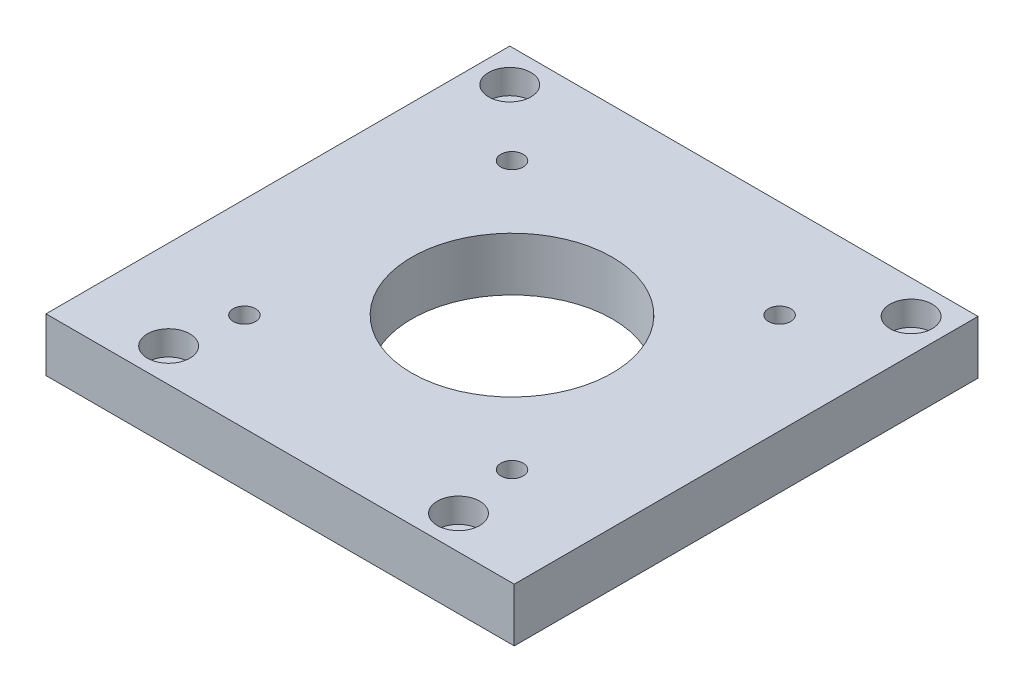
ISO-10303-21;
HEADER;
FILE_DESCRIPTION(('STEP AP214'),'2;1');
FILE_NAME('part.step','',(''),(''),'','','');
FILE_SCHEMA(('AUTOMOTIVE_DESIGN { 1 0 10303 214 1 1 1 1 }'));
ENDSEC;
DATA;
#1=APPLICATION_CONTEXT('core data for automotive mechanical design processes');
#2=APPLICATION_PROTOCOL_DEFINITION('international standard','automotive_design',2000,#1);
#3=PRODUCT_CONTEXT('',#1,'mechanical');
#4=PRODUCT('Part','Part','',(#3));
#5=PRODUCT_RELATED_PRODUCT_CATEGORY('part','',(#4));
#6=PRODUCT_DEFINITION_FORMATION('','',#4);
#7=PRODUCT_DEFINITION_CONTEXT('part definition',#1,'design');
#8=PRODUCT_DEFINITION('design','',#6,#7);
#9=PRODUCT_DEFINITION_SHAPE('','',#8);
#10=(LENGTH_UNIT() NAMED_UNIT(*) SI_UNIT(.MILLI.,.METRE.));
#11=(NAMED_UNIT(*) PLANE_ANGLE_UNIT() SI_UNIT($,.RADIAN.));
#12=(NAMED_UNIT(*) SI_UNIT($,.STERADIAN.) SOLID_ANGLE_UNIT());
#13=UNCERTAINTY_MEASURE_WITH_UNIT(LENGTH_MEASURE(1.E-05),#10,'distance_accuracy_value','');
#14=(GEOMETRIC_REPRESENTATION_CONTEXT(3) GLOBAL_UNCERTAINTY_ASSIGNED_CONTEXT((#13)) GLOBAL_UNIT_ASSIGNED_CONTEXT((#10,
#11,#12)) REPRESENTATION_CONTEXT('',''));
#15=CARTESIAN_POINT('',(0.,0.,0.));
#16=DIRECTION('',(0.,0.,1.));
#17=DIRECTION('',(1.,0.,0.));
#18=AXIS2_PLACEMENT_3D('',#15,#16,#17);
#19=CARTESIAN_POINT('',(20.,-92.,96.5));
#20=DIRECTION('',(0.,1.,0.));
#21=DIRECTION('',(0.,0.,1.));
#22=AXIS2_PLACEMENT_3D('',#19,#20,#21);
#23=CYLINDRICAL_SURFACE('',#22,2.75);
#24=CARTESIAN_POINT('',(20.,0.,96.5));
#25=DIRECTION('',(0.,1.,0.));
#26=DIRECTION('',(0.,0.,1.));
#27=AXIS2_PLACEMENT_3D('',#24,#25,#26);
#28=CIRCLE('',#27,2.75);
#29=CARTESIAN_POINT('',(20.,0.,99.25));
#30=VERTEX_POINT('',#29);
#31=EDGE_CURVE('E171',#30,#30,#28,.T.);
#32=CARTESIAN_POINT('',(20.,6.50000000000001,96.5));
#33=DIRECTION('',(0.,1.,0.));
#34=DIRECTION('',(0.,0.,1.));
#35=AXIS2_PLACEMENT_3D('',#32,#33,#34);
#36=CIRCLE('',#35,2.75);
#37=CARTESIAN_POINT('',(20.,6.49999999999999,99.25));
#38=VERTEX_POINT('',#37);
#39=EDGE_CURVE('E36',#38,#38,#36,.F.);
#40=CARTESIAN_POINT('',(20.,0.,99.25));
#41=CARTESIAN_POINT('',(20.,0.0677083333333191,99.25));
#42=CARTESIAN_POINT('',(20.,0.135416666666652,99.25));
#43=CARTESIAN_POINT('',(20.,0.270833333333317,99.25));
#44=CARTESIAN_POINT('',(20.,0.33854166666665,99.25));
#45=CARTESIAN_POINT('',(20.,0.473958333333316,99.25));
#46=CARTESIAN_POINT('',(20.,0.541666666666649,99.25));
#47=CARTESIAN_POINT('',(20.,0.677083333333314,99.25));
#48=CARTESIAN_POINT('',(20.,0.744791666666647,99.25));
#49=CARTESIAN_POINT('',(20.,0.880208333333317,99.25));
#50=CARTESIAN_POINT('',(20.,0.947916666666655,99.25));
#51=CARTESIAN_POINT('',(20.,1.08333333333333,99.25));
#52=CARTESIAN_POINT('',(20.,1.15104166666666,99.25));
#53=CARTESIAN_POINT('',(20.,1.28645833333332,99.25));
#54=CARTESIAN_POINT('',(20.,1.35416666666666,99.25));
#55=CARTESIAN_POINT('',(20.,1.48958333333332,99.25));
#56=CARTESIAN_POINT('',(20.,1.55729166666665,99.25));
#57=CARTESIAN_POINT('',(20.,1.69270833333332,99.25));
#58=CARTESIAN_POINT('',(20.,1.76041666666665,99.25));
#59=CARTESIAN_POINT('',(20.,1.89583333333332,99.25));
#60=CARTESIAN_POINT('',(20.,1.96354166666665,99.25));
#61=CARTESIAN_POINT('',(20.,2.09895833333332,99.25));
#62=CARTESIAN_POINT('',(20.,2.16666666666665,99.25));
#63=CARTESIAN_POINT('',(20.,2.30208333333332,99.25));
#64=CARTESIAN_POINT('',(20.,2.36979166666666,99.25));
#65=CARTESIAN_POINT('',(20.,2.50520833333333,99.25));
#66=CARTESIAN_POINT('',(20.,2.57291666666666,99.25));
#67=CARTESIAN_POINT('',(20.,2.70833333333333,99.25));
#68=CARTESIAN_POINT('',(20.,2.77604166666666,99.25));
#69=CARTESIAN_POINT('',(20.,2.91145833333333,99.25));
#70=CARTESIAN_POINT('',(20.,2.97916666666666,99.25));
#71=CARTESIAN_POINT('',(20.,3.11458333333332,99.25));
#72=CARTESIAN_POINT('',(20.,3.18229166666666,99.25));
#73=CARTESIAN_POINT('',(20.,3.31770833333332,99.25));
#74=CARTESIAN_POINT('',(20.,3.38541666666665,99.25));
#75=CARTESIAN_POINT('',(20.,3.52083333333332,99.25));
#76=CARTESIAN_POINT('',(20.,3.58854166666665,99.25));
#77=CARTESIAN_POINT('',(20.,3.72395833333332,99.25));
#78=CARTESIAN_POINT('',(20.,3.79166666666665,99.25));
#79=CARTESIAN_POINT('',(20.,3.92708333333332,99.25));
#80=CARTESIAN_POINT('',(20.,3.99479166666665,99.25));
#81=CARTESIAN_POINT('',(20.,4.13020833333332,99.25));
#82=CARTESIAN_POINT('',(20.,4.19791666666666,99.25));
#83=CARTESIAN_POINT('',(20.,4.33333333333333,99.25));
#84=CARTESIAN_POINT('',(20.,4.40104166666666,99.25));
#85=CARTESIAN_POINT('',(20.,4.53645833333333,99.25));
#86=CARTESIAN_POINT('',(20.,4.60416666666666,99.25));
#87=CARTESIAN_POINT('',(20.,4.73958333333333,99.25));
#88=CARTESIAN_POINT('',(20.,4.80729166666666,99.25));
#89=CARTESIAN_POINT('',(20.,4.94270833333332,99.25));
#90=CARTESIAN_POINT('',(20.,5.01041666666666,99.25));
#91=CARTESIAN_POINT('',(20.,5.14583333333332,99.25));
#92=CARTESIAN_POINT('',(20.,5.21354166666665,99.25));
#93=CARTESIAN_POINT('',(20.,5.34895833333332,99.25));
#94=CARTESIAN_POINT('',(20.,5.41666666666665,99.25));
#95=CARTESIAN_POINT('',(20.,5.55208333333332,99.25));
#96=CARTESIAN_POINT('',(20.,5.61979166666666,99.25));
#97=CARTESIAN_POINT('',(20.,5.75520833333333,99.25));
#98=CARTESIAN_POINT('',(20.,5.82291666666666,99.25));
#99=CARTESIAN_POINT('',(20.,5.95833333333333,99.25));
#100=CARTESIAN_POINT('',(20.,6.02604166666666,99.25));
#101=CARTESIAN_POINT('',(20.,6.16145833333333,99.25));
#102=CARTESIAN_POINT('',(20.,6.22916666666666,99.25));
#103=CARTESIAN_POINT('',(20.,6.36458333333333,99.25));
#104=CARTESIAN_POINT('',(20.,6.43229166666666,99.25));
#105=CARTESIAN_POINT('',(20.,6.49999999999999,99.25));
#106=B_SPLINE_CURVE_WITH_KNOTS('',3,(#40,#41,#42,#43,#44,#45,#46,#47,#48,#49,#50,#51,#52,#53,
#54,#55,#56,#57,#58,#59,#60,#61,#62,#63,#64,#65,#66,#67,#68,#69,#70,#71,#72,#73,#74,#75,#76,#77,
#78,#79,#80,#81,#82,#83,#84,#85,#86,#87,#88,#89,#90,#91,#92,#93,#94,#95,#96,#97,#98,#99,#100,
#101,#102,#103,#104,#105),.UNSPECIFIED.,.F.,.F.,(4,2,2,2,2,2,2,2,2,2,2,2,2,2,2,2,2,2,2,2,2,2,2,
2,2,2,2,2,2,2,2,2,4),(0.,0.203124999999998,0.406249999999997,0.609374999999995,
0.812499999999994,1.01562500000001,1.21875,1.421875,1.625,1.828125,2.03125,2.234375,
2.43750000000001,2.64062500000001,2.84375000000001,3.046875,3.25,3.453125,3.65625,3.859375,
4.0625,4.26562500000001,4.46875000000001,4.67187500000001,4.875,5.078125,5.28125,5.484375,
5.68750000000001,5.89062500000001,6.09375000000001,6.29687500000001,6.50000000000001),.UNSPECIFIED.);
#107=EDGE_CURVE('BSEAM32',#30,#38,#106,.T.);
#108=ORIENTED_EDGE('',*,*,#31,.F.);
#109=ORIENTED_EDGE('',*,*,#39,.F.);
#110=ORIENTED_EDGE('',*,*,#107,.T.);
#111=ORIENTED_EDGE('',*,*,#107,.F.);
#112=EDGE_LOOP('',(#108,#110,#109,#111));
#113=FACE_BOUND('',#112,.T.);
#114=ADVANCED_FACE('F32',(#113),#23,.F.);
#115=CARTESIAN_POINT('',(85.,-92.,96.5));
#116=DIRECTION('',(0.,1.,0.));
#117=DIRECTION('',(0.,0.,1.));
#118=AXIS2_PLACEMENT_3D('',#115,#116,#117);
#119=CYLINDRICAL_SURFACE('',#118,2.75);
#120=CARTESIAN_POINT('',(85.,0.,96.5));
#121=DIRECTION('',(0.,1.,0.));
#122=DIRECTION('',(0.,0.,1.));
#123=AXIS2_PLACEMENT_3D('',#120,#121,#122);
#124=CIRCLE('',#123,2.75);
#125=CARTESIAN_POINT('',(85.,0.,99.25));
#126=VERTEX_POINT('',#125);
#127=EDGE_CURVE('E174',#126,#126,#124,.T.);
#128=CARTESIAN_POINT('',(85.,6.50000000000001,96.5));
#129=DIRECTION('',(0.,1.,0.));
#130=DIRECTION('',(0.,0.,1.));
#131=AXIS2_PLACEMENT_3D('',#128,#129,#130);
#132=CIRCLE('',#131,2.75);
#133=CARTESIAN_POINT('',(85.,6.49999999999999,99.25));
#134=VERTEX_POINT('',#133);
#135=EDGE_CURVE('E117',#134,#134,#132,.F.);
#136=CARTESIAN_POINT('',(85.,0.,99.25));
#137=CARTESIAN_POINT('',(85.,0.0677083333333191,99.25));
#138=CARTESIAN_POINT('',(85.,0.135416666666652,99.25));
#139=CARTESIAN_POINT('',(85.,0.270833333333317,99.25));
#140=CARTESIAN_POINT('',(85.,0.33854166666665,99.25));
#141=CARTESIAN_POINT('',(85.,0.473958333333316,99.25));
#142=CARTESIAN_POINT('',(85.,0.541666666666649,99.25));
#143=CARTESIAN_POINT('',(85.,0.677083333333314,99.25));
#144=CARTESIAN_POINT('',(85.,0.744791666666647,99.25));
#145=CARTESIAN_POINT('',(85.,0.880208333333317,99.25));
#146=CARTESIAN_POINT('',(85.,0.947916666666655,99.25));
#147=CARTESIAN_POINT('',(85.,1.08333333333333,99.25));
#148=CARTESIAN_POINT('',(85.,1.15104166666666,99.25));
#149=CARTESIAN_POINT('',(85.,1.28645833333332,99.25));
#150=CARTESIAN_POINT('',(85.,1.35416666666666,99.25));
#151=CARTESIAN_POINT('',(85.,1.48958333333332,99.25));
#152=CARTESIAN_POINT('',(85.,1.55729166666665,99.25));
#153=CARTESIAN_POINT('',(85.,1.69270833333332,99.25));
#154=CARTESIAN_POINT('',(85.,1.76041666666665,99.25));
#155=CARTESIAN_POINT('',(85.,1.89583333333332,99.25));
#156=CARTESIAN_POINT('',(85.,1.96354166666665,99.25));
#157=CARTESIAN_POINT('',(85.,2.09895833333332,99.25));
#158=CARTESIAN_POINT('',(85.,2.16666666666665,99.25));
#159=CARTESIAN_POINT('',(85.,2.30208333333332,99.25));
#160=CARTESIAN_POINT('',(85.,2.36979166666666,99.25));
#161=CARTESIAN_POINT('',(85.,2.50520833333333,99.25));
#162=CARTESIAN_POINT('',(85.,2.57291666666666,99.25));
#163=CARTESIAN_POINT('',(85.,2.70833333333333,99.25));
#164=CARTESIAN_POINT('',(85.,2.77604166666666,99.25));
#165=CARTESIAN_POINT('',(85.,2.91145833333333,99.25));
#166=CARTESIAN_POINT('',(85.,2.97916666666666,99.25));
#167=CARTESIAN_POINT('',(85.,3.11458333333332,99.25));
#168=CARTESIAN_POINT('',(85.,3.18229166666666,99.25));
#169=CARTESIAN_POINT('',(85.,3.31770833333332,99.25));
#170=CARTESIAN_POINT('',(85.,3.38541666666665,99.25));
#171=CARTESIAN_POINT('',(85.,3.52083333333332,99.25));
#172=CARTESIAN_POINT('',(85.,3.58854166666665,99.25));
#173=CARTESIAN_POINT('',(85.,3.72395833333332,99.25));
#174=CARTESIAN_POINT('',(85.,3.79166666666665,99.25));
#175=CARTESIAN_POINT('',(85.,3.92708333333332,99.25));
#176=CARTESIAN_POINT('',(85.,3.99479166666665,99.25));
#177=CARTESIAN_POINT('',(85.,4.13020833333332,99.25));
#178=CARTESIAN_POINT('',(85.,4.19791666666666,99.25));
#179=CARTESIAN_POINT('',(85.,4.33333333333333,99.25));
#180=CARTESIAN_POINT('',(85.,4.40104166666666,99.25));
#181=CARTESIAN_POINT('',(85.,4.53645833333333,99.25));
#182=CARTESIAN_POINT('',(85.,4.60416666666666,99.25));
#183=CARTESIAN_POINT('',(85.,4.73958333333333,99.25));
#184=CARTESIAN_POINT('',(85.,4.80729166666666,99.25));
#185=CARTESIAN_POINT('',(85.,4.94270833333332,99.25));
#186=CARTESIAN_POINT('',(85.,5.01041666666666,99.25));
#187=CARTESIAN_POINT('',(85.,5.14583333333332,99.25));
#188=CARTESIAN_POINT('',(85.,5.21354166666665,99.25));
#189=CARTESIAN_POINT('',(85.,5.34895833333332,99.25));
#190=CARTESIAN_POINT('',(85.,5.41666666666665,99.25));
#191=CARTESIAN_POINT('',(85.,5.55208333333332,99.25));
#192=CARTESIAN_POINT('',(85.,5.61979166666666,99.25));
#193=CARTESIAN_POINT('',(85.,5.75520833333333,99.25));
#194=CARTESIAN_POINT('',(85.,5.82291666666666,99.25));
#195=CARTESIAN_POINT('',(85.,5.95833333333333,99.25));
#196=CARTESIAN_POINT('',(85.,6.02604166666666,99.25));
#197=CARTESIAN_POINT('',(85.,6.16145833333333,99.25));
#198=CARTESIAN_POINT('',(85.,6.22916666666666,99.25));
#199=CARTESIAN_POINT('',(85.,6.36458333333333,99.25));
#200=CARTESIAN_POINT('',(85.,6.43229166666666,99.25));
#201=CARTESIAN_POINT('',(85.,6.49999999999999,99.25));
#202=B_SPLINE_CURVE_WITH_KNOTS('',3,(#136,#137,#138,#139,#140,#141,#142,#143,#144,#145,#146,
#147,#148,#149,#150,#151,#152,#153,#154,#155,#156,#157,#158,#159,#160,#161,#162,#163,#164,#165,
#166,#167,#168,#169,#170,#171,#172,#173,#174,#175,#176,#177,#178,#179,#180,#181,#182,#183,#184,
#185,#186,#187,#188,#189,#190,#191,#192,#193,#194,#195,#196,#197,#198,#199,#200,#201),
.UNSPECIFIED.,.F.,.F.,(4,2,2,2,2,2,2,2,2,2,2,2,2,2,2,2,2,2,2,2,2,2,2,2,2,2,2,2,2,2,2,2,4),(0.,
0.203124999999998,0.406249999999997,0.609374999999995,0.812499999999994,1.01562500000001,
1.21875,1.421875,1.625,1.828125,2.03125,2.234375,2.43750000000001,2.64062500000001,
2.84375000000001,3.046875,3.25,3.453125,3.65625,3.859375,4.0625,4.26562500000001,
4.46875000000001,4.67187500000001,4.875,5.078125,5.28125,5.484375,5.68750000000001,
5.89062500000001,6.09375000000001,6.29687500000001,6.50000000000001),.UNSPECIFIED.);
#203=EDGE_CURVE('BSEAM209',#126,#134,#202,.T.);
#204=ORIENTED_EDGE('',*,*,#127,.F.);
#205=ORIENTED_EDGE('',*,*,#135,.F.);
#206=ORIENTED_EDGE('',*,*,#203,.T.);
#207=ORIENTED_EDGE('',*,*,#203,.F.);
#208=EDGE_LOOP('',(#204,#206,#205,#207));
#209=FACE_BOUND('',#208,.T.);
#210=ADVANCED_FACE('F209',(#209),#119,.F.);
#211=CARTESIAN_POINT('',(97.5,-92.,7.5));
#212=DIRECTION('',(0.,1.,0.));
#213=DIRECTION('',(0.,0.,1.));
#214=AXIS2_PLACEMENT_3D('',#211,#212,#213);
#215=CYLINDRICAL_SURFACE('',#214,2.75);
#216=CARTESIAN_POINT('',(97.5,0.,7.5));
#217=DIRECTION('',(0.,1.,0.));
#218=DIRECTION('',(0.,0.,1.));
#219=AXIS2_PLACEMENT_3D('',#216,#217,#218);
#220=CIRCLE('',#219,2.75);
#221=CARTESIAN_POINT('',(97.5,0.,10.25));
#222=VERTEX_POINT('',#221);
#223=EDGE_CURVE('E177',#222,#222,#220,.T.);
#224=CARTESIAN_POINT('',(97.5,6.50000000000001,7.5));
#225=DIRECTION('',(0.,1.,0.));
#226=DIRECTION('',(0.,0.,1.));
#227=AXIS2_PLACEMENT_3D('',#224,#225,#226);
#228=CIRCLE('',#227,2.75);
#229=CARTESIAN_POINT('',(97.5,6.49999999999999,10.25));
#230=VERTEX_POINT('',#229);
#231=EDGE_CURVE('E113',#230,#230,#228,.F.);
#232=CARTESIAN_POINT('',(97.5,0.,10.25));
#233=CARTESIAN_POINT('',(97.5,0.0677083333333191,10.25));
#234=CARTESIAN_POINT('',(97.5,0.135416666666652,10.25));
#235=CARTESIAN_POINT('',(97.5,0.270833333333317,10.25));
#236=CARTESIAN_POINT('',(97.5,0.33854166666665,10.25));
#237=CARTESIAN_POINT('',(97.5,0.473958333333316,10.25));
#238=CARTESIAN_POINT('',(97.5,0.541666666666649,10.25));
#239=CARTESIAN_POINT('',(97.5,0.677083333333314,10.25));
#240=CARTESIAN_POINT('',(97.5,0.744791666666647,10.25));
#241=CARTESIAN_POINT('',(97.5,0.880208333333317,10.25));
#242=CARTESIAN_POINT('',(97.5,0.947916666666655,10.25));
#243=CARTESIAN_POINT('',(97.5,1.08333333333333,10.25));
#244=CARTESIAN_POINT('',(97.5,1.15104166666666,10.25));
#245=CARTESIAN_POINT('',(97.5,1.28645833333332,10.25));
#246=CARTESIAN_POINT('',(97.5,1.35416666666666,10.25));
#247=CARTESIAN_POINT('',(97.5,1.48958333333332,10.25));
#248=CARTESIAN_POINT('',(97.5,1.55729166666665,10.25));
#249=CARTESIAN_POINT('',(97.5,1.69270833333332,10.25));
#250=CARTESIAN_POINT('',(97.5,1.76041666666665,10.25));
#251=CARTESIAN_POINT('',(97.5,1.89583333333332,10.25));
#252=CARTESIAN_POINT('',(97.5,1.96354166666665,10.25));
#253=CARTESIAN_POINT('',(97.5,2.09895833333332,10.25));
#254=CARTESIAN_POINT('',(97.5,2.16666666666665,10.25));
#255=CARTESIAN_POINT('',(97.5,2.30208333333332,10.25));
#256=CARTESIAN_POINT('',(97.5,2.36979166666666,10.25));
#257=CARTESIAN_POINT('',(97.5,2.50520833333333,10.25));
#258=CARTESIAN_POINT('',(97.5,2.57291666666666,10.25));
#259=CARTESIAN_POINT('',(97.5,2.70833333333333,10.25));
#260=CARTESIAN_POINT('',(97.5,2.77604166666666,10.25));
#261=CARTESIAN_POINT('',(97.5,2.91145833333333,10.25));
#262=CARTESIAN_POINT('',(97.5,2.97916666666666,10.25));
#263=CARTESIAN_POINT('',(97.5,3.11458333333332,10.25));
#264=CARTESIAN_POINT('',(97.5,3.18229166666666,10.25));
#265=CARTESIAN_POINT('',(97.5,3.31770833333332,10.25));
#266=CARTESIAN_POINT('',(97.5,3.38541666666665,10.25));
#267=CARTESIAN_POINT('',(97.5,3.52083333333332,10.25));
#268=CARTESIAN_POINT('',(97.5,3.58854166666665,10.25));
#269=CARTESIAN_POINT('',(97.5,3.72395833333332,10.25));
#270=CARTESIAN_POINT('',(97.5,3.79166666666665,10.25));
#271=CARTESIAN_POINT('',(97.5,3.92708333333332,10.25));
#272=CARTESIAN_POINT('',(97.5,3.99479166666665,10.25));
#273=CARTESIAN_POINT('',(97.5,4.13020833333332,10.25));
#274=CARTESIAN_POINT('',(97.5,4.19791666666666,10.25));
#275=CARTESIAN_POINT('',(97.5,4.33333333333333,10.25));
#276=CARTESIAN_POINT('',(97.5,4.40104166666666,10.25));
#277=CARTESIAN_POINT('',(97.5,4.53645833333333,10.25));
#278=CARTESIAN_POINT('',(97.5,4.60416666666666,10.25));
#279=CARTESIAN_POINT('',(97.5,4.73958333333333,10.25));
#280=CARTESIAN_POINT('',(97.5,4.80729166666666,10.25));
#281=CARTESIAN_POINT('',(97.5,4.94270833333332,10.25));
#282=CARTESIAN_POINT('',(97.5,5.01041666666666,10.25));
#283=CARTESIAN_POINT('',(97.5,5.14583333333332,10.25));
#284=CARTESIAN_POINT('',(97.5,5.21354166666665,10.25));
#285=CARTESIAN_POINT('',(97.5,5.34895833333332,10.25));
#286=CARTESIAN_POINT('',(97.5,5.41666666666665,10.25));
#287=CARTESIAN_POINT('',(97.5,5.55208333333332,10.25));
#288=CARTESIAN_POINT('',(97.5,5.61979166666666,10.25));
#289=CARTESIAN_POINT('',(97.5,5.75520833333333,10.25));
#290=CARTESIAN_POINT('',(97.5,5.82291666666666,10.25));
#291=CARTESIAN_POINT('',(97.5,5.95833333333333,10.25));
#292=CARTESIAN_POINT('',(97.5,6.02604166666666,10.25));
#293=CARTESIAN_POINT('',(97.5,6.16145833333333,10.25));
#294=CARTESIAN_POINT('',(97.5,6.22916666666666,10.25));
#295=CARTESIAN_POINT('',(97.5,6.36458333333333,10.25));
#296=CARTESIAN_POINT('',(97.5,6.43229166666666,10.25));
#297=CARTESIAN_POINT('',(97.5,6.49999999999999,10.25));
#298=B_SPLINE_CURVE_WITH_KNOTS('',3,(#232,#233,#234,#235,#236,#237,#238,#239,#240,#241,#242,
#243,#244,#245,#246,#247,#248,#249,#250,#251,#252,#253,#254,#255,#256,#257,#258,#259,#260,#261,
#262,#263,#264,#265,#266,#267,#268,#269,#270,#271,#272,#273,#274,#275,#276,#277,#278,#279,#280,
#281,#282,#283,#284,#285,#286,#287,#288,#289,#290,#291,#292,#293,#294,#295,#296,#297),
.UNSPECIFIED.,.F.,.F.,(4,2,2,2,2,2,2,2,2,2,2,2,2,2,2,2,2,2,2,2,2,2,2,2,2,2,2,2,2,2,2,2,4),(0.,
0.203124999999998,0.406249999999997,0.609374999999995,0.812499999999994,1.01562500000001,
1.21875,1.421875,1.625,1.828125,2.03125,2.234375,2.43750000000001,2.64062500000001,
2.84375000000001,3.046875,3.25,3.453125,3.65625,3.859375,4.0625,4.26562500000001,
4.46875000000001,4.67187500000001,4.875,5.078125,5.28125,5.484375,5.68750000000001,
5.89062500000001,6.09375000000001,6.29687500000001,6.50000000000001),.UNSPECIFIED.);
#299=EDGE_CURVE('BSEAM187',#222,#230,#298,.T.);
#300=ORIENTED_EDGE('',*,*,#223,.F.);
#301=ORIENTED_EDGE('',*,*,#231,.F.);
#302=ORIENTED_EDGE('',*,*,#299,.T.);
#303=ORIENTED_EDGE('',*,*,#299,.F.);
#304=EDGE_LOOP('',(#300,#302,#301,#303));
#305=FACE_BOUND('',#304,.T.);
#306=ADVANCED_FACE('F187',(#305),#215,.F.);
#307=CARTESIAN_POINT('',(7.5,-92.,7.5));
#308=DIRECTION('',(0.,1.,0.));
#309=DIRECTION('',(0.,0.,1.));
#310=AXIS2_PLACEMENT_3D('',#307,#308,#309);
#311=CYLINDRICAL_SURFACE('',#310,2.75);
#312=CARTESIAN_POINT('',(7.5,0.,7.5));
#313=DIRECTION('',(0.,1.,0.));
#314=DIRECTION('',(0.,0.,1.));
#315=AXIS2_PLACEMENT_3D('',#312,#313,#314);
#316=CIRCLE('',#315,2.75);
#317=CARTESIAN_POINT('',(7.5,0.,10.25));
#318=VERTEX_POINT('',#317);
#319=EDGE_CURVE('E102',#318,#318,#316,.T.);
#320=CARTESIAN_POINT('',(7.5,6.50000000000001,7.5));
#321=DIRECTION('',(0.,1.,0.));
#322=DIRECTION('',(0.,0.,1.));
#323=AXIS2_PLACEMENT_3D('',#320,#321,#322);
#324=CIRCLE('',#323,2.75);
#325=CARTESIAN_POINT('',(7.5,6.49999999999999,10.25));
#326=VERTEX_POINT('',#325);
#327=EDGE_CURVE('E108',#326,#326,#324,.F.);
#328=CARTESIAN_POINT('',(7.5,0.,10.25));
#329=CARTESIAN_POINT('',(7.5,0.0677083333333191,10.25));
#330=CARTESIAN_POINT('',(7.5,0.135416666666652,10.25));
#331=CARTESIAN_POINT('',(7.5,0.270833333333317,10.25));
#332=CARTESIAN_POINT('',(7.5,0.33854166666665,10.25));
#333=CARTESIAN_POINT('',(7.5,0.473958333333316,10.25));
#334=CARTESIAN_POINT('',(7.5,0.541666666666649,10.25));
#335=CARTESIAN_POINT('',(7.5,0.677083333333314,10.25));
#336=CARTESIAN_POINT('',(7.5,0.744791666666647,10.25));
#337=CARTESIAN_POINT('',(7.5,0.880208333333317,10.25));
#338=CARTESIAN_POINT('',(7.5,0.947916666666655,10.25));
#339=CARTESIAN_POINT('',(7.5,1.08333333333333,10.25));
#340=CARTESIAN_POINT('',(7.5,1.15104166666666,10.25));
#341=CARTESIAN_POINT('',(7.5,1.28645833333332,10.25));
#342=CARTESIAN_POINT('',(7.5,1.35416666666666,10.25));
#343=CARTESIAN_POINT('',(7.5,1.48958333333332,10.25));
#344=CARTESIAN_POINT('',(7.5,1.55729166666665,10.25));
#345=CARTESIAN_POINT('',(7.5,1.69270833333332,10.25));
#346=CARTESIAN_POINT('',(7.5,1.76041666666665,10.25));
#347=CARTESIAN_POINT('',(7.5,1.89583333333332,10.25));
#348=CARTESIAN_POINT('',(7.5,1.96354166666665,10.25));
#349=CARTESIAN_POINT('',(7.5,2.09895833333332,10.25));
#350=CARTESIAN_POINT('',(7.5,2.16666666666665,10.25));
#351=CARTESIAN_POINT('',(7.5,2.30208333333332,10.25));
#352=CARTESIAN_POINT('',(7.5,2.36979166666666,10.25));
#353=CARTESIAN_POINT('',(7.5,2.50520833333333,10.25));
#354=CARTESIAN_POINT('',(7.5,2.57291666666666,10.25));
#355=CARTESIAN_POINT('',(7.5,2.70833333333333,10.25));
#356=CARTESIAN_POINT('',(7.5,2.77604166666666,10.25));
#357=CARTESIAN_POINT('',(7.5,2.91145833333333,10.25));
#358=CARTESIAN_POINT('',(7.5,2.97916666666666,10.25));
#359=CARTESIAN_POINT('',(7.5,3.11458333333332,10.25));
#360=CARTESIAN_POINT('',(7.5,3.18229166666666,10.25));
#361=CARTESIAN_POINT('',(7.5,3.31770833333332,10.25));
#362=CARTESIAN_POINT('',(7.5,3.38541666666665,10.25));
#363=CARTESIAN_POINT('',(7.5,3.52083333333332,10.25));
#364=CARTESIAN_POINT('',(7.5,3.58854166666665,10.25));
#365=CARTESIAN_POINT('',(7.5,3.72395833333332,10.25));
#366=CARTESIAN_POINT('',(7.5,3.79166666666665,10.25));
#367=CARTESIAN_POINT('',(7.5,3.92708333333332,10.25));
#368=CARTESIAN_POINT('',(7.5,3.99479166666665,10.25));
#369=CARTESIAN_POINT('',(7.5,4.13020833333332,10.25));
#370=CARTESIAN_POINT('',(7.5,4.19791666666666,10.25));
#371=CARTESIAN_POINT('',(7.5,4.33333333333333,10.25));
#372=CARTESIAN_POINT('',(7.5,4.40104166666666,10.25));
#373=CARTESIAN_POINT('',(7.5,4.53645833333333,10.25));
#374=CARTESIAN_POINT('',(7.5,4.60416666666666,10.25));
#375=CARTESIAN_POINT('',(7.5,4.73958333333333,10.25));
#376=CARTESIAN_POINT('',(7.5,4.80729166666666,10.25));
#377=CARTESIAN_POINT('',(7.5,4.94270833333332,10.25));
#378=CARTESIAN_POINT('',(7.5,5.01041666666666,10.25));
#379=CARTESIAN_POINT('',(7.5,5.14583333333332,10.25));
#380=CARTESIAN_POINT('',(7.5,5.21354166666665,10.25));
#381=CARTESIAN_POINT('',(7.5,5.34895833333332,10.25));
#382=CARTESIAN_POINT('',(7.5,5.41666666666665,10.25));
#383=CARTESIAN_POINT('',(7.5,5.55208333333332,10.25));
#384=CARTESIAN_POINT('',(7.5,5.61979166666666,10.25));
#385=CARTESIAN_POINT('',(7.5,5.75520833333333,10.25));
#386=CARTESIAN_POINT('',(7.5,5.82291666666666,10.25));
#387=CARTESIAN_POINT('',(7.5,5.95833333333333,10.25));
#388=CARTESIAN_POINT('',(7.5,6.02604166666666,10.25));
#389=CARTESIAN_POINT('',(7.5,6.16145833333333,10.25));
#390=CARTESIAN_POINT('',(7.5,6.22916666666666,10.25));
#391=CARTESIAN_POINT('',(7.5,6.36458333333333,10.25));
#392=CARTESIAN_POINT('',(7.5,6.43229166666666,10.25));
#393=CARTESIAN_POINT('',(7.5,6.49999999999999,10.25));
#394=B_SPLINE_CURVE_WITH_KNOTS('',3,(#328,#329,#330,#331,#332,#333,#334,#335,#336,#337,#338,
#339,#340,#341,#342,#343,#344,#345,#346,#347,#348,#349,#350,#351,#352,#353,#354,#355,#356,#357,
#358,#359,#360,#361,#362,#363,#364,#365,#366,#367,#368,#369,#370,#371,#372,#373,#374,#375,#376,
#377,#378,#379,#380,#381,#382,#383,#384,#385,#386,#387,#388,#389,#390,#391,#392,#393),
.UNSPECIFIED.,.F.,.F.,(4,2,2,2,2,2,2,2,2,2,2,2,2,2,2,2,2,2,2,2,2,2,2,2,2,2,2,2,2,2,2,2,4),(0.,
0.203124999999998,0.406249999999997,0.609374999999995,0.812499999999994,1.01562500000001,
1.21875,1.421875,1.625,1.828125,2.03125,2.234375,2.43750000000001,2.64062500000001,
2.84375000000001,3.046875,3.25,3.453125,3.65625,3.859375,4.0625,4.26562500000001,
4.46875000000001,4.67187500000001,4.875,5.078125,5.28125,5.484375,5.68750000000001,
5.89062500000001,6.09375000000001,6.29687500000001,6.50000000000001),.UNSPECIFIED.);
#395=EDGE_CURVE('BSEAM184',#318,#326,#394,.T.);
#396=ORIENTED_EDGE('',*,*,#319,.F.);
#397=ORIENTED_EDGE('',*,*,#327,.F.);
#398=ORIENTED_EDGE('',*,*,#395,.T.);
#399=ORIENTED_EDGE('',*,*,#395,.F.);
#400=EDGE_LOOP('',(#396,#398,#397,#399));
#401=FACE_BOUND('',#400,.T.);
#402=ADVANCED_FACE('F184',(#401),#311,.F.);
#403=CARTESIAN_POINT('',(0.,0.,104.));
#404=DIRECTION('',(1.,0.,0.));
#405=DIRECTION('',(0.,0.,-1.));
#406=AXIS2_PLACEMENT_3D('',#403,#404,#405);
#407=PLANE('',#406);
#408=DIRECTION('',(0.,-1.,0.));
#409=VECTOR('',#408,1.);
#410=CARTESIAN_POINT('',(0.,0.,0.));
#411=LINE('',#410,#409);
#412=CARTESIAN_POINT('',(0.,12.,0.));
#413=VERTEX_POINT('',#412);
#414=CARTESIAN_POINT('',(0.,0.,0.));
#415=VERTEX_POINT('',#414);
#416=EDGE_CURVE('E99',#413,#415,#411,.T.);
#417=ORIENTED_EDGE('',*,*,#416,.T.);
#418=DIRECTION('',(0.,0.,-1.));
#419=VECTOR('',#418,1.);
#420=CARTESIAN_POINT('',(0.,0.,104.));
#421=LINE('',#420,#419);
#422=CARTESIAN_POINT('',(0.,0.,104.));
#423=VERTEX_POINT('',#422);
#424=EDGE_CURVE('E11',#423,#415,#421,.T.);
#425=ORIENTED_EDGE('',*,*,#424,.F.);
#426=DIRECTION('',(0.,-1.,0.));
#427=VECTOR('',#426,1.);
#428=CARTESIAN_POINT('',(0.,0.,104.));
#429=LINE('',#428,#427);
#430=CARTESIAN_POINT('',(0.,12.,104.));
#431=VERTEX_POINT('',#430);
#432=EDGE_CURVE('E86',#431,#423,#429,.T.);
#433=ORIENTED_EDGE('',*,*,#432,.F.);
#434=DIRECTION('',(0.,0.,-1.));
#435=VECTOR('',#434,1.);
#436=CARTESIAN_POINT('',(0.,12.,104.));
#437=LINE('',#436,#435);
#438=EDGE_CURVE('E95',#431,#413,#437,.T.);
#439=ORIENTED_EDGE('',*,*,#438,.T.);
#440=EDGE_LOOP('',(#417,#425,#433,#439));
#441=FACE_BOUND('',#440,.T.);
#442=ADVANCED_FACE('F34',(#441),#407,.F.);
#443=CARTESIAN_POINT('',(0.,0.,104.));
#444=DIRECTION('',(0.,1.,0.));
#445=DIRECTION('',(0.,0.,1.));
#446=AXIS2_PLACEMENT_3D('',#443,#444,#445);
#447=PLANE('',#446);
#448=CARTESIAN_POINT('',(22.5,0.,82.));
#449=DIRECTION('',(0.,1.,0.));
#450=DIRECTION('',(0.,0.,1.));
#451=AXIS2_PLACEMENT_3D('',#448,#449,#450);
#452=CIRCLE('',#451,2.5);
#453=CARTESIAN_POINT('',(22.5,0.,84.5));
#454=VERTEX_POINT('',#453);
#455=EDGE_CURVE('E144',#454,#454,#452,.T.);
#456=ORIENTED_EDGE('',*,*,#455,.T.);
#457=EDGE_LOOP('',(#456));
#458=FACE_BOUND('',#457,.T.);
#459=CARTESIAN_POINT('',(82.5,0.,82.));
#460=DIRECTION('',(0.,1.,0.));
#461=DIRECTION('',(0.,0.,1.));
#462=AXIS2_PLACEMENT_3D('',#459,#460,#461);
#463=CIRCLE('',#462,2.5);
#464=CARTESIAN_POINT('',(82.5,0.,84.5));
#465=VERTEX_POINT('',#464);
#466=EDGE_CURVE('E150',#465,#465,#463,.T.);
#467=ORIENTED_EDGE('',*,*,#466,.T.);
#468=EDGE_LOOP('',(#467));
#469=FACE_BOUND('',#468,.T.);
#470=CARTESIAN_POINT('',(82.5,0.,22.));
#471=DIRECTION('',(0.,1.,0.));
#472=DIRECTION('',(0.,0.,1.));
#473=AXIS2_PLACEMENT_3D('',#470,#471,#472);
#474=CIRCLE('',#473,2.5);
#475=CARTESIAN_POINT('',(82.5,0.,24.5));
#476=VERTEX_POINT('',#475);
#477=EDGE_CURVE('E156',#476,#476,#474,.T.);
#478=ORIENTED_EDGE('',*,*,#477,.T.);
#479=EDGE_LOOP('',(#478));
#480=FACE_BOUND('',#479,.T.);
#481=CARTESIAN_POINT('',(22.5,0.,22.));
#482=DIRECTION('',(0.,1.,0.));
#483=DIRECTION('',(0.,0.,1.));
#484=AXIS2_PLACEMENT_3D('',#481,#482,#483);
#485=CIRCLE('',#484,2.5);
#486=CARTESIAN_POINT('',(22.5,0.,24.5));
#487=VERTEX_POINT('',#486);
#488=EDGE_CURVE('E162',#487,#487,#485,.T.);
#489=ORIENTED_EDGE('',*,*,#488,.T.);
#490=EDGE_LOOP('',(#489));
#491=FACE_BOUND('',#490,.T.);
#492=CARTESIAN_POINT('',(52.5,0.,52.));
#493=DIRECTION('',(0.,1.,0.));
#494=DIRECTION('',(0.,0.,1.));
#495=AXIS2_PLACEMENT_3D('',#492,#493,#494);
#496=CIRCLE('',#495,22.5);
#497=CARTESIAN_POINT('',(52.5,0.,74.5));
#498=VERTEX_POINT('',#497);
#499=EDGE_CURVE('E168',#498,#498,#496,.T.);
#500=ORIENTED_EDGE('',*,*,#499,.T.);
#501=EDGE_LOOP('',(#500));
#502=FACE_BOUND('',#501,.T.);
#503=ORIENTED_EDGE('',*,*,#31,.T.);
#504=EDGE_LOOP('',(#503));
#505=FACE_BOUND('',#504,.T.);
#506=ORIENTED_EDGE('',*,*,#127,.T.);
#507=EDGE_LOOP('',(#506));
#508=FACE_BOUND('',#507,.T.);
#509=ORIENTED_EDGE('',*,*,#223,.T.);
#510=EDGE_LOOP('',(#509));
#511=FACE_BOUND('',#510,.T.);
#512=ORIENTED_EDGE('',*,*,#319,.T.);
#513=EDGE_LOOP('',(#512));
#514=FACE_BOUND('',#513,.T.);
#515=DIRECTION('',(1.,0.,0.));
#516=VECTOR('',#515,1.);
#517=CARTESIAN_POINT('',(0.,0.,0.));
#518=LINE('',#517,#516);
#519=CARTESIAN_POINT('',(105.,0.,0.));
#520=VERTEX_POINT('',#519);
#521=EDGE_CURVE('E90',#415,#520,#518,.T.);
#522=ORIENTED_EDGE('',*,*,#521,.T.);
#523=DIRECTION('',(0.,0.,-1.));
#524=VECTOR('',#523,1.);
#525=CARTESIAN_POINT('',(105.,0.,104.));
#526=LINE('',#525,#524);
#527=CARTESIAN_POINT('',(105.,0.,104.));
#528=VERTEX_POINT('',#527);
#529=EDGE_CURVE('E42',#528,#520,#526,.T.);
#530=ORIENTED_EDGE('',*,*,#529,.F.);
#531=DIRECTION('',(1.,0.,0.));
#532=VECTOR('',#531,1.);
#533=CARTESIAN_POINT('',(0.,0.,104.));
#534=LINE('',#533,#532);
#535=EDGE_CURVE('E81',#423,#528,#534,.T.);
#536=ORIENTED_EDGE('',*,*,#535,.F.);
#537=ORIENTED_EDGE('',*,*,#424,.T.);
#538=EDGE_LOOP('',(#522,#530,#536,#537));
#539=FACE_BOUND('',#538,.T.);
#540=ADVANCED_FACE('F89',(#458,#469,#480,#491,#502,#505,#508,#511,#514,#539),#447,.F.);
#541=CARTESIAN_POINT('',(105.,0.,104.));
#542=DIRECTION('',(-1.,0.,0.));
#543=DIRECTION('',(0.,0.,1.));
#544=AXIS2_PLACEMENT_3D('',#541,#542,#543);
#545=PLANE('',#544);
#546=DIRECTION('',(0.,1.,0.));
#547=VECTOR('',#546,1.);
#548=CARTESIAN_POINT('',(105.,0.,0.));
#549=LINE('',#548,#547);
#550=CARTESIAN_POINT('',(105.,12.,0.));
#551=VERTEX_POINT('',#550);
#552=EDGE_CURVE('E68',#520,#551,#549,.T.);
#553=ORIENTED_EDGE('',*,*,#552,.T.);
#554=DIRECTION('',(0.,0.,-1.));
#555=VECTOR('',#554,1.);
#556=CARTESIAN_POINT('',(105.,12.,104.));
#557=LINE('',#556,#555);
#558=CARTESIAN_POINT('',(105.,12.,104.));
#559=VERTEX_POINT('',#558);
#560=EDGE_CURVE('E91',#559,#551,#557,.T.);
#561=ORIENTED_EDGE('',*,*,#560,.F.);
#562=DIRECTION('',(0.,1.,0.));
#563=VECTOR('',#562,1.);
#564=CARTESIAN_POINT('',(105.,0.,104.));
#565=LINE('',#564,#563);
#566=EDGE_CURVE('E84',#528,#559,#565,.T.);
#567=ORIENTED_EDGE('',*,*,#566,.F.);
#568=ORIENTED_EDGE('',*,*,#529,.T.);
#569=EDGE_LOOP('',(#553,#561,#567,#568));
#570=FACE_BOUND('',#569,.T.);
#571=ADVANCED_FACE('F93',(#570),#545,.F.);
#572=CARTESIAN_POINT('',(0.,12.,104.));
#573=DIRECTION('',(0.,-1.,0.));
#574=DIRECTION('',(0.,0.,-1.));
#575=AXIS2_PLACEMENT_3D('',#572,#573,#574);
#576=PLANE('',#575);
#577=CARTESIAN_POINT('',(20.,12.,96.5));
#578=DIRECTION('',(0.,1.,0.));
#579=DIRECTION('',(0.,0.,1.));
#580=AXIS2_PLACEMENT_3D('',#577,#578,#579);
#581=CIRCLE('',#580,4.75);
#582=CARTESIAN_POINT('',(20.,12.,101.25));
#583=VERTEX_POINT('',#582);
#584=EDGE_CURVE('E133',#583,#583,#581,.T.);
#585=ORIENTED_EDGE('',*,*,#584,.F.);
#586=EDGE_LOOP('',(#585));
#587=FACE_BOUND('',#586,.T.);
#588=CARTESIAN_POINT('',(85.,12.,96.5));
#589=DIRECTION('',(0.,1.,0.));
#590=DIRECTION('',(0.,0.,1.));
#591=AXIS2_PLACEMENT_3D('',#588,#589,#590);
#592=CIRCLE('',#591,4.75);
#593=CARTESIAN_POINT('',(85.,12.,101.25));
#594=VERTEX_POINT('',#593);
#595=EDGE_CURVE('E126',#594,#594,#592,.T.);
#596=ORIENTED_EDGE('',*,*,#595,.F.);
#597=EDGE_LOOP('',(#596));
#598=FACE_BOUND('',#597,.T.);
#599=CARTESIAN_POINT('',(97.5,12.,7.5));
#600=DIRECTION('',(0.,1.,0.));
#601=DIRECTION('',(0.,0.,1.));
#602=AXIS2_PLACEMENT_3D('',#599,#600,#601);
#603=CIRCLE('',#602,4.75);
#604=CARTESIAN_POINT('',(97.5,12.,12.25));
#605=VERTEX_POINT('',#604);
#606=EDGE_CURVE('E119',#605,#605,#603,.T.);
#607=ORIENTED_EDGE('',*,*,#606,.F.);
#608=EDGE_LOOP('',(#607));
#609=FACE_BOUND('',#608,.T.);
#610=CARTESIAN_POINT('',(7.5,12.,7.5));
#611=DIRECTION('',(0.,1.,0.));
#612=DIRECTION('',(0.,0.,1.));
#613=AXIS2_PLACEMENT_3D('',#610,#611,#612);
#614=CIRCLE('',#613,4.75);
#615=CARTESIAN_POINT('',(7.5,12.,12.25));
#616=VERTEX_POINT('',#615);
#617=EDGE_CURVE('E115',#616,#616,#614,.T.);
#618=ORIENTED_EDGE('',*,*,#617,.F.);
#619=EDGE_LOOP('',(#618));
#620=FACE_BOUND('',#619,.T.);
#621=CARTESIAN_POINT('',(22.5,12.,82.));
#622=DIRECTION('',(0.,1.,0.));
#623=DIRECTION('',(0.,0.,1.));
#624=AXIS2_PLACEMENT_3D('',#621,#622,#623);
#625=CIRCLE('',#624,2.5);
#626=CARTESIAN_POINT('',(22.5,12.,84.5));
#627=VERTEX_POINT('',#626);
#628=EDGE_CURVE('E111',#627,#627,#625,.T.);
#629=ORIENTED_EDGE('',*,*,#628,.F.);
#630=EDGE_LOOP('',(#629));
#631=FACE_BOUND('',#630,.T.);
#632=CARTESIAN_POINT('',(82.5,12.,82.));
#633=DIRECTION('',(0.,1.,0.));
#634=DIRECTION('',(0.,0.,1.));
#635=AXIS2_PLACEMENT_3D('',#632,#633,#634);
#636=CIRCLE('',#635,2.5);
#637=CARTESIAN_POINT('',(82.5,12.,84.5));
#638=VERTEX_POINT('',#637);
#639=EDGE_CURVE('E147',#638,#638,#636,.T.);
#640=ORIENTED_EDGE('',*,*,#639,.F.);
#641=EDGE_LOOP('',(#640));
#642=FACE_BOUND('',#641,.T.);
#643=CARTESIAN_POINT('',(82.5,12.,22.));
#644=DIRECTION('',(0.,1.,0.));
#645=DIRECTION('',(0.,0.,1.));
#646=AXIS2_PLACEMENT_3D('',#643,#644,#645);
#647=CIRCLE('',#646,2.5);
#648=CARTESIAN_POINT('',(82.5,12.,24.5));
#649=VERTEX_POINT('',#648);
#650=EDGE_CURVE('E153',#649,#649,#647,.T.);
#651=ORIENTED_EDGE('',*,*,#650,.F.);
#652=EDGE_LOOP('',(#651));
#653=FACE_BOUND('',#652,.T.);
#654=CARTESIAN_POINT('',(22.5,12.,22.));
#655=DIRECTION('',(0.,1.,0.));
#656=DIRECTION('',(0.,0.,1.));
#657=AXIS2_PLACEMENT_3D('',#654,#655,#656);
#658=CIRCLE('',#657,2.5);
#659=CARTESIAN_POINT('',(22.5,12.,24.5));
#660=VERTEX_POINT('',#659);
#661=EDGE_CURVE('E159',#660,#660,#658,.T.);
#662=ORIENTED_EDGE('',*,*,#661,.F.);
#663=EDGE_LOOP('',(#662));
#664=FACE_BOUND('',#663,.T.);
#665=CARTESIAN_POINT('',(52.5,12.,52.));
#666=DIRECTION('',(0.,1.,0.));
#667=DIRECTION('',(0.,0.,1.));
#668=AXIS2_PLACEMENT_3D('',#665,#666,#667);
#669=CIRCLE('',#668,22.5);
#670=CARTESIAN_POINT('',(52.5,12.,74.5));
#671=VERTEX_POINT('',#670);
#672=EDGE_CURVE('E165',#671,#671,#669,.T.);
#673=ORIENTED_EDGE('',*,*,#672,.F.);
#674=EDGE_LOOP('',(#673));
#675=FACE_BOUND('',#674,.T.);
#676=DIRECTION('',(-1.,0.,0.));
#677=VECTOR('',#676,1.);
#678=CARTESIAN_POINT('',(0.,12.,0.));
#679=LINE('',#678,#677);
#680=EDGE_CURVE('E74',#551,#413,#679,.T.);
#681=ORIENTED_EDGE('',*,*,#680,.T.);
#682=ORIENTED_EDGE('',*,*,#438,.F.);
#683=DIRECTION('',(-1.,0.,0.));
#684=VECTOR('',#683,1.);
#685=CARTESIAN_POINT('',(0.,12.,104.));
#686=LINE('',#685,#684);
#687=EDGE_CURVE('E51',#559,#431,#686,.T.);
#688=ORIENTED_EDGE('',*,*,#687,.F.);
#689=ORIENTED_EDGE('',*,*,#560,.T.);
#690=EDGE_LOOP('',(#681,#682,#688,#689));
#691=FACE_BOUND('',#690,.T.);
#692=ADVANCED_FACE('F229',(#587,#598,#609,#620,#631,#642,#653,#664,#675,#691),#576,.F.);
#693=CARTESIAN_POINT('',(0.,12.,104.));
#694=DIRECTION('',(0.,0.,-1.));
#695=DIRECTION('',(-1.,0.,0.));
#696=AXIS2_PLACEMENT_3D('',#693,#694,#695);
#697=PLANE('',#696);
#698=ORIENTED_EDGE('',*,*,#432,.T.);
#699=ORIENTED_EDGE('',*,*,#535,.T.);
#700=ORIENTED_EDGE('',*,*,#566,.T.);
#701=ORIENTED_EDGE('',*,*,#687,.T.);
#702=EDGE_LOOP('',(#698,#699,#700,#701));
#703=FACE_BOUND('',#702,.T.);
#704=ADVANCED_FACE('F82',(#703),#697,.F.);
#705=CARTESIAN_POINT('',(0.,12.,0.));
#706=DIRECTION('',(0.,0.,-1.));
#707=DIRECTION('',(-1.,0.,0.));
#708=AXIS2_PLACEMENT_3D('',#705,#706,#707);
#709=PLANE('',#708);
#710=ORIENTED_EDGE('',*,*,#416,.F.);
#711=ORIENTED_EDGE('',*,*,#680,.F.);
#712=ORIENTED_EDGE('',*,*,#552,.F.);
#713=ORIENTED_EDGE('',*,*,#521,.F.);
#714=EDGE_LOOP('',(#710,#711,#712,#713));
#715=FACE_BOUND('',#714,.T.);
#716=ADVANCED_FACE('F228',(#715),#709,.T.);
#717=CARTESIAN_POINT('',(52.5,-92.,52.));
#718=DIRECTION('',(0.,1.,0.));
#719=DIRECTION('',(0.,0.,1.));
#720=AXIS2_PLACEMENT_3D('',#717,#718,#719);
#721=CYLINDRICAL_SURFACE('',#720,22.5);
#722=CARTESIAN_POINT('',(52.5,12.,74.5));
#723=CARTESIAN_POINT('',(52.5,11.875,74.5));
#724=CARTESIAN_POINT('',(52.5,11.75,74.5));
#725=CARTESIAN_POINT('',(52.5,11.5,74.5));
#726=CARTESIAN_POINT('',(52.5,11.375,74.5));
#727=CARTESIAN_POINT('',(52.5,11.125,74.5));
#728=CARTESIAN_POINT('',(52.5,11.,74.5));
#729=CARTESIAN_POINT('',(52.5,10.75,74.5));
#730=CARTESIAN_POINT('',(52.5,10.625,74.5));
#731=CARTESIAN_POINT('',(52.5,10.375,74.5));
#732=CARTESIAN_POINT('',(52.5,10.25,74.5));
#733=CARTESIAN_POINT('',(52.5,9.99999999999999,74.5));
#734=CARTESIAN_POINT('',(52.5,9.87499999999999,74.5));
#735=CARTESIAN_POINT('',(52.5,9.62499999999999,74.5));
#736=CARTESIAN_POINT('',(52.5,9.49999999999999,74.5));
#737=CARTESIAN_POINT('',(52.5,9.24999999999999,74.5));
#738=CARTESIAN_POINT('',(52.5,9.12499999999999,74.5));
#739=CARTESIAN_POINT('',(52.5,8.87499999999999,74.5));
#740=CARTESIAN_POINT('',(52.5,8.74999999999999,74.5));
#741=CARTESIAN_POINT('',(52.5,8.49999999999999,74.5));
#742=CARTESIAN_POINT('',(52.5,8.37499999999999,74.5));
#743=CARTESIAN_POINT('',(52.5,8.12499999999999,74.5));
#744=CARTESIAN_POINT('',(52.5,7.99999999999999,74.5));
#745=CARTESIAN_POINT('',(52.5,7.74999999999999,74.5));
#746=CARTESIAN_POINT('',(52.5,7.62499999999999,74.5));
#747=CARTESIAN_POINT('',(52.5,7.37499999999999,74.5));
#748=CARTESIAN_POINT('',(52.5,7.24999999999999,74.5));
#749=CARTESIAN_POINT('',(52.5,6.99999999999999,74.5));
#750=CARTESIAN_POINT('',(52.5,6.87499999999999,74.5));
#751=CARTESIAN_POINT('',(52.5,6.62499999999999,74.5));
#752=CARTESIAN_POINT('',(52.5,6.49999999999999,74.5));
#753=CARTESIAN_POINT('',(52.5,6.24999999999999,74.5));
#754=CARTESIAN_POINT('',(52.5,6.12499999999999,74.5));
#755=CARTESIAN_POINT('',(52.5,5.87499999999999,74.5));
#756=CARTESIAN_POINT('',(52.5,5.74999999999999,74.5));
#757=CARTESIAN_POINT('',(52.5,5.49999999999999,74.5));
#758=CARTESIAN_POINT('',(52.5,5.37499999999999,74.5));
#759=CARTESIAN_POINT('',(52.5,5.12499999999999,74.5));
#760=CARTESIAN_POINT('',(52.5,4.99999999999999,74.5));
#761=CARTESIAN_POINT('',(52.5,4.74999999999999,74.5));
#762=CARTESIAN_POINT('',(52.5,4.62499999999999,74.5));
#763=CARTESIAN_POINT('',(52.5,4.37499999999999,74.5));
#764=CARTESIAN_POINT('',(52.5,4.24999999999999,74.5));
#765=CARTESIAN_POINT('',(52.5,3.99999999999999,74.5));
#766=CARTESIAN_POINT('',(52.5,3.87499999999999,74.5));
#767=CARTESIAN_POINT('',(52.5,3.62499999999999,74.5));
#768=CARTESIAN_POINT('',(52.5,3.49999999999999,74.5));
#769=CARTESIAN_POINT('',(52.5,3.24999999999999,74.5));
#770=CARTESIAN_POINT('',(52.5,3.12499999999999,74.5));
#771=CARTESIAN_POINT('',(52.5,2.87499999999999,74.5));
#772=CARTESIAN_POINT('',(52.5,2.74999999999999,74.5));
#773=CARTESIAN_POINT('',(52.5,2.49999999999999,74.5));
#774=CARTESIAN_POINT('',(52.5,2.37499999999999,74.5));
#775=CARTESIAN_POINT('',(52.5,2.12499999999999,74.5));
#776=CARTESIAN_POINT('',(52.5,1.99999999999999,74.5));
#777=CARTESIAN_POINT('',(52.5,1.74999999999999,74.5));
#778=CARTESIAN_POINT('',(52.5,1.62499999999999,74.5));
#779=CARTESIAN_POINT('',(52.5,1.37499999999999,74.5));
#780=CARTESIAN_POINT('',(52.5,1.24999999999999,74.5));
#781=CARTESIAN_POINT('',(52.5,0.999999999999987,74.5));
#782=CARTESIAN_POINT('',(52.5,0.874999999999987,74.5));
#783=CARTESIAN_POINT('',(52.5,0.624999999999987,74.5));
#784=CARTESIAN_POINT('',(52.5,0.499999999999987,74.5));
#785=CARTESIAN_POINT('',(52.5,0.249999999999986,74.5));
#786=CARTESIAN_POINT('',(52.5,0.124999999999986,74.5));
#787=CARTESIAN_POINT('',(52.5,0.,74.5));
#788=B_SPLINE_CURVE_WITH_KNOTS('',3,(#722,#723,#724,#725,#726,#727,#728,#729,#730,#731,#732,
#733,#734,#735,#736,#737,#738,#739,#740,#741,#742,#743,#744,#745,#746,#747,#748,#749,#750,#751,
#752,#753,#754,#755,#756,#757,#758,#759,#760,#761,#762,#763,#764,#765,#766,#767,#768,#769,#770,
#771,#772,#773,#774,#775,#776,#777,#778,#779,#780,#781,#782,#783,#784,#785,#786,#787),
.UNSPECIFIED.,.F.,.F.,(4,2,2,2,2,2,2,2,2,2,2,2,2,2,2,2,2,2,2,2,2,2,2,2,2,2,2,2,2,2,2,2,4),(0.,
0.375,0.750000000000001,1.125,1.5,1.875,2.25,2.625,3.,3.375,3.75,4.125,4.5,4.875,5.25,
5.62500000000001,6.00000000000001,6.37500000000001,6.75000000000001,7.12500000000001,
7.50000000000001,7.87500000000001,8.25000000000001,8.62500000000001,9.00000000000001,
9.37500000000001,9.75000000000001,10.125,10.5,10.875,11.25,11.625,12.),.UNSPECIFIED.);
#789=EDGE_CURVE('BSEAM220',#671,#498,#788,.T.);
#790=ORIENTED_EDGE('',*,*,#672,.T.);
#791=ORIENTED_EDGE('',*,*,#499,.F.);
#792=ORIENTED_EDGE('',*,*,#789,.T.);
#793=ORIENTED_EDGE('',*,*,#789,.F.);
#794=EDGE_LOOP('',(#790,#792,#791,#793));
#795=FACE_BOUND('',#794,.T.);
#796=ADVANCED_FACE('F220',(#795),#721,.F.);
#797=CARTESIAN_POINT('',(22.5,-92.,22.));
#798=DIRECTION('',(0.,1.,0.));
#799=DIRECTION('',(0.,0.,1.));
#800=AXIS2_PLACEMENT_3D('',#797,#798,#799);
#801=CYLINDRICAL_SURFACE('',#800,2.5);
#802=CARTESIAN_POINT('',(22.5,12.,24.5));
#803=CARTESIAN_POINT('',(22.5,11.875,24.5));
#804=CARTESIAN_POINT('',(22.5,11.75,24.5));
#805=CARTESIAN_POINT('',(22.5,11.5,24.5));
#806=CARTESIAN_POINT('',(22.5,11.375,24.5));
#807=CARTESIAN_POINT('',(22.5,11.125,24.5));
#808=CARTESIAN_POINT('',(22.5,11.,24.5));
#809=CARTESIAN_POINT('',(22.5,10.75,24.5));
#810=CARTESIAN_POINT('',(22.5,10.625,24.5));
#811=CARTESIAN_POINT('',(22.5,10.375,24.5));
#812=CARTESIAN_POINT('',(22.5,10.25,24.5));
#813=CARTESIAN_POINT('',(22.5,9.99999999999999,24.5));
#814=CARTESIAN_POINT('',(22.5,9.87499999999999,24.5));
#815=CARTESIAN_POINT('',(22.5,9.62499999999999,24.5));
#816=CARTESIAN_POINT('',(22.5,9.49999999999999,24.5));
#817=CARTESIAN_POINT('',(22.5,9.24999999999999,24.5));
#818=CARTESIAN_POINT('',(22.5,9.12499999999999,24.5));
#819=CARTESIAN_POINT('',(22.5,8.87499999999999,24.5));
#820=CARTESIAN_POINT('',(22.5,8.74999999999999,24.5));
#821=CARTESIAN_POINT('',(22.5,8.49999999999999,24.5));
#822=CARTESIAN_POINT('',(22.5,8.37499999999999,24.5));
#823=CARTESIAN_POINT('',(22.5,8.12499999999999,24.5));
#824=CARTESIAN_POINT('',(22.5,7.99999999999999,24.5));
#825=CARTESIAN_POINT('',(22.5,7.74999999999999,24.5));
#826=CARTESIAN_POINT('',(22.5,7.62499999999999,24.5));
#827=CARTESIAN_POINT('',(22.5,7.37499999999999,24.5));
#828=CARTESIAN_POINT('',(22.5,7.24999999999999,24.5));
#829=CARTESIAN_POINT('',(22.5,6.99999999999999,24.5));
#830=CARTESIAN_POINT('',(22.5,6.87499999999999,24.5));
#831=CARTESIAN_POINT('',(22.5,6.62499999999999,24.5));
#832=CARTESIAN_POINT('',(22.5,6.49999999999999,24.5));
#833=CARTESIAN_POINT('',(22.5,6.24999999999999,24.5));
#834=CARTESIAN_POINT('',(22.5,6.12499999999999,24.5));
#835=CARTESIAN_POINT('',(22.5,5.87499999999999,24.5));
#836=CARTESIAN_POINT('',(22.5,5.74999999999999,24.5));
#837=CARTESIAN_POINT('',(22.5,5.49999999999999,24.5));
#838=CARTESIAN_POINT('',(22.5,5.37499999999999,24.5));
#839=CARTESIAN_POINT('',(22.5,5.12499999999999,24.5));
#840=CARTESIAN_POINT('',(22.5,4.99999999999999,24.5));
#841=CARTESIAN_POINT('',(22.5,4.74999999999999,24.5));
#842=CARTESIAN_POINT('',(22.5,4.62499999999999,24.5));
#843=CARTESIAN_POINT('',(22.5,4.37499999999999,24.5));
#844=CARTESIAN_POINT('',(22.5,4.24999999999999,24.5));
#845=CARTESIAN_POINT('',(22.5,3.99999999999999,24.5));
#846=CARTESIAN_POINT('',(22.5,3.87499999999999,24.5));
#847=CARTESIAN_POINT('',(22.5,3.62499999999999,24.5));
#848=CARTESIAN_POINT('',(22.5,3.49999999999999,24.5));
#849=CARTESIAN_POINT('',(22.5,3.24999999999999,24.5));
#850=CARTESIAN_POINT('',(22.5,3.12499999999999,24.5));
#851=CARTESIAN_POINT('',(22.5,2.87499999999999,24.5));
#852=CARTESIAN_POINT('',(22.5,2.74999999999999,24.5));
#853=CARTESIAN_POINT('',(22.5,2.49999999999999,24.5));
#854=CARTESIAN_POINT('',(22.5,2.37499999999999,24.5));
#855=CARTESIAN_POINT('',(22.5,2.12499999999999,24.5));
#856=CARTESIAN_POINT('',(22.5,1.99999999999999,24.5));
#857=CARTESIAN_POINT('',(22.5,1.74999999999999,24.5));
#858=CARTESIAN_POINT('',(22.5,1.62499999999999,24.5));
#859=CARTESIAN_POINT('',(22.5,1.37499999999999,24.5));
#860=CARTESIAN_POINT('',(22.5,1.24999999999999,24.5));
#861=CARTESIAN_POINT('',(22.5,0.999999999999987,24.5));
#862=CARTESIAN_POINT('',(22.5,0.874999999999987,24.5));
#863=CARTESIAN_POINT('',(22.5,0.624999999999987,24.5));
#864=CARTESIAN_POINT('',(22.5,0.499999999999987,24.5));
#865=CARTESIAN_POINT('',(22.5,0.249999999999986,24.5));
#866=CARTESIAN_POINT('',(22.5,0.124999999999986,24.5));
#867=CARTESIAN_POINT('',(22.5,0.,24.5));
#868=B_SPLINE_CURVE_WITH_KNOTS('',3,(#802,#803,#804,#805,#806,#807,#808,#809,#810,#811,#812,
#813,#814,#815,#816,#817,#818,#819,#820,#821,#822,#823,#824,#825,#826,#827,#828,#829,#830,#831,
#832,#833,#834,#835,#836,#837,#838,#839,#840,#841,#842,#843,#844,#845,#846,#847,#848,#849,#850,
#851,#852,#853,#854,#855,#856,#857,#858,#859,#860,#861,#862,#863,#864,#865,#866,#867),
.UNSPECIFIED.,.F.,.F.,(4,2,2,2,2,2,2,2,2,2,2,2,2,2,2,2,2,2,2,2,2,2,2,2,2,2,2,2,2,2,2,2,4),(0.,
0.375,0.750000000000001,1.125,1.5,1.875,2.25,2.625,3.,3.375,3.75,4.125,4.5,4.875,5.25,
5.62500000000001,6.00000000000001,6.37500000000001,6.75000000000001,7.12500000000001,
7.50000000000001,7.87500000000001,8.25000000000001,8.62500000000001,9.00000000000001,
9.37500000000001,9.75000000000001,10.125,10.5,10.875,11.25,11.625,12.),.UNSPECIFIED.);
#869=EDGE_CURVE('BSEAM313',#660,#487,#868,.T.);
#870=ORIENTED_EDGE('',*,*,#661,.T.);
#871=ORIENTED_EDGE('',*,*,#488,.F.);
#872=ORIENTED_EDGE('',*,*,#869,.T.);
#873=ORIENTED_EDGE('',*,*,#869,.F.);
#874=EDGE_LOOP('',(#870,#872,#871,#873));
#875=FACE_BOUND('',#874,.T.);
#876=ADVANCED_FACE('F313',(#875),#801,.F.);
#877=CARTESIAN_POINT('',(82.5,-92.,22.));
#878=DIRECTION('',(0.,1.,0.));
#879=DIRECTION('',(0.,0.,1.));
#880=AXIS2_PLACEMENT_3D('',#877,#878,#879);
#881=CYLINDRICAL_SURFACE('',#880,2.5);
#882=CARTESIAN_POINT('',(82.5,12.,24.5));
#883=CARTESIAN_POINT('',(82.5,11.875,24.5));
#884=CARTESIAN_POINT('',(82.5,11.75,24.5));
#885=CARTESIAN_POINT('',(82.5,11.5,24.5));
#886=CARTESIAN_POINT('',(82.5,11.375,24.5));
#887=CARTESIAN_POINT('',(82.5,11.125,24.5));
#888=CARTESIAN_POINT('',(82.5,11.,24.5));
#889=CARTESIAN_POINT('',(82.5,10.75,24.5));
#890=CARTESIAN_POINT('',(82.5,10.625,24.5));
#891=CARTESIAN_POINT('',(82.5,10.375,24.5));
#892=CARTESIAN_POINT('',(82.5,10.25,24.5));
#893=CARTESIAN_POINT('',(82.5,9.99999999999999,24.5));
#894=CARTESIAN_POINT('',(82.5,9.87499999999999,24.5));
#895=CARTESIAN_POINT('',(82.5,9.62499999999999,24.5));
#896=CARTESIAN_POINT('',(82.5,9.49999999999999,24.5));
#897=CARTESIAN_POINT('',(82.5,9.24999999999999,24.5));
#898=CARTESIAN_POINT('',(82.5,9.12499999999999,24.5));
#899=CARTESIAN_POINT('',(82.5,8.87499999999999,24.5));
#900=CARTESIAN_POINT('',(82.5,8.74999999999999,24.5));
#901=CARTESIAN_POINT('',(82.5,8.49999999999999,24.5));
#902=CARTESIAN_POINT('',(82.5,8.37499999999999,24.5));
#903=CARTESIAN_POINT('',(82.5,8.12499999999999,24.5));
#904=CARTESIAN_POINT('',(82.5,7.99999999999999,24.5));
#905=CARTESIAN_POINT('',(82.5,7.74999999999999,24.5));
#906=CARTESIAN_POINT('',(82.5,7.62499999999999,24.5));
#907=CARTESIAN_POINT('',(82.5,7.37499999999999,24.5));
#908=CARTESIAN_POINT('',(82.5,7.24999999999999,24.5));
#909=CARTESIAN_POINT('',(82.5,6.99999999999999,24.5));
#910=CARTESIAN_POINT('',(82.5,6.87499999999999,24.5));
#911=CARTESIAN_POINT('',(82.5,6.62499999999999,24.5));
#912=CARTESIAN_POINT('',(82.5,6.49999999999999,24.5));
#913=CARTESIAN_POINT('',(82.5,6.24999999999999,24.5));
#914=CARTESIAN_POINT('',(82.5,6.12499999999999,24.5));
#915=CARTESIAN_POINT('',(82.5,5.87499999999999,24.5));
#916=CARTESIAN_POINT('',(82.5,5.74999999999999,24.5));
#917=CARTESIAN_POINT('',(82.5,5.49999999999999,24.5));
#918=CARTESIAN_POINT('',(82.5,5.37499999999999,24.5));
#919=CARTESIAN_POINT('',(82.5,5.12499999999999,24.5));
#920=CARTESIAN_POINT('',(82.5,4.99999999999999,24.5));
#921=CARTESIAN_POINT('',(82.5,4.74999999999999,24.5));
#922=CARTESIAN_POINT('',(82.5,4.62499999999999,24.5));
#923=CARTESIAN_POINT('',(82.5,4.37499999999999,24.5));
#924=CARTESIAN_POINT('',(82.5,4.24999999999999,24.5));
#925=CARTESIAN_POINT('',(82.5,3.99999999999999,24.5));
#926=CARTESIAN_POINT('',(82.5,3.87499999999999,24.5));
#927=CARTESIAN_POINT('',(82.5,3.62499999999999,24.5));
#928=CARTESIAN_POINT('',(82.5,3.49999999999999,24.5));
#929=CARTESIAN_POINT('',(82.5,3.24999999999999,24.5));
#930=CARTESIAN_POINT('',(82.5,3.12499999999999,24.5));
#931=CARTESIAN_POINT('',(82.5,2.87499999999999,24.5));
#932=CARTESIAN_POINT('',(82.5,2.74999999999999,24.5));
#933=CARTESIAN_POINT('',(82.5,2.49999999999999,24.5));
#934=CARTESIAN_POINT('',(82.5,2.37499999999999,24.5));
#935=CARTESIAN_POINT('',(82.5,2.12499999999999,24.5));
#936=CARTESIAN_POINT('',(82.5,1.99999999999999,24.5));
#937=CARTESIAN_POINT('',(82.5,1.74999999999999,24.5));
#938=CARTESIAN_POINT('',(82.5,1.62499999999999,24.5));
#939=CARTESIAN_POINT('',(82.5,1.37499999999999,24.5));
#940=CARTESIAN_POINT('',(82.5,1.24999999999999,24.5));
#941=CARTESIAN_POINT('',(82.5,0.999999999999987,24.5));
#942=CARTESIAN_POINT('',(82.5,0.874999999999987,24.5));
#943=CARTESIAN_POINT('',(82.5,0.624999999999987,24.5));
#944=CARTESIAN_POINT('',(82.5,0.499999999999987,24.5));
#945=CARTESIAN_POINT('',(82.5,0.249999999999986,24.5));
#946=CARTESIAN_POINT('',(82.5,0.124999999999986,24.5));
#947=CARTESIAN_POINT('',(82.5,0.,24.5));
#948=B_SPLINE_CURVE_WITH_KNOTS('',3,(#882,#883,#884,#885,#886,#887,#888,#889,#890,#891,#892,
#893,#894,#895,#896,#897,#898,#899,#900,#901,#902,#903,#904,#905,#906,#907,#908,#909,#910,#911,
#912,#913,#914,#915,#916,#917,#918,#919,#920,#921,#922,#923,#924,#925,#926,#927,#928,#929,#930,
#931,#932,#933,#934,#935,#936,#937,#938,#939,#940,#941,#942,#943,#944,#945,#946,#947),
.UNSPECIFIED.,.F.,.F.,(4,2,2,2,2,2,2,2,2,2,2,2,2,2,2,2,2,2,2,2,2,2,2,2,2,2,2,2,2,2,2,2,4),(0.,
0.375,0.750000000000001,1.125,1.5,1.875,2.25,2.625,3.,3.375,3.75,4.125,4.5,4.875,5.25,
5.62500000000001,6.00000000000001,6.37500000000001,6.75000000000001,7.12500000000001,
7.50000000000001,7.87500000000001,8.25000000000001,8.62500000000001,9.00000000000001,
9.37500000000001,9.75000000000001,10.125,10.5,10.875,11.25,11.625,12.),.UNSPECIFIED.);
#949=EDGE_CURVE('BSEAM317',#649,#476,#948,.T.);
#950=ORIENTED_EDGE('',*,*,#650,.T.);
#951=ORIENTED_EDGE('',*,*,#477,.F.);
#952=ORIENTED_EDGE('',*,*,#949,.T.);
#953=ORIENTED_EDGE('',*,*,#949,.F.);
#954=EDGE_LOOP('',(#950,#952,#951,#953));
#955=FACE_BOUND('',#954,.T.);
#956=ADVANCED_FACE('F317',(#955),#881,.F.);
#957=CARTESIAN_POINT('',(82.5,-92.,82.));
#958=DIRECTION('',(0.,1.,0.));
#959=DIRECTION('',(0.,0.,1.));
#960=AXIS2_PLACEMENT_3D('',#957,#958,#959);
#961=CYLINDRICAL_SURFACE('',#960,2.5);
#962=CARTESIAN_POINT('',(82.5,12.,84.5));
#963=CARTESIAN_POINT('',(82.5,11.875,84.5));
#964=CARTESIAN_POINT('',(82.5,11.75,84.5));
#965=CARTESIAN_POINT('',(82.5,11.5,84.5));
#966=CARTESIAN_POINT('',(82.5,11.375,84.5));
#967=CARTESIAN_POINT('',(82.5,11.125,84.5));
#968=CARTESIAN_POINT('',(82.5,11.,84.5));
#969=CARTESIAN_POINT('',(82.5,10.75,84.5));
#970=CARTESIAN_POINT('',(82.5,10.625,84.5));
#971=CARTESIAN_POINT('',(82.5,10.375,84.5));
#972=CARTESIAN_POINT('',(82.5,10.25,84.5));
#973=CARTESIAN_POINT('',(82.5,9.99999999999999,84.5));
#974=CARTESIAN_POINT('',(82.5,9.87499999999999,84.5));
#975=CARTESIAN_POINT('',(82.5,9.62499999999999,84.5));
#976=CARTESIAN_POINT('',(82.5,9.49999999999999,84.5));
#977=CARTESIAN_POINT('',(82.5,9.24999999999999,84.5));
#978=CARTESIAN_POINT('',(82.5,9.12499999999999,84.5));
#979=CARTESIAN_POINT('',(82.5,8.87499999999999,84.5));
#980=CARTESIAN_POINT('',(82.5,8.74999999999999,84.5));
#981=CARTESIAN_POINT('',(82.5,8.49999999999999,84.5));
#982=CARTESIAN_POINT('',(82.5,8.37499999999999,84.5));
#983=CARTESIAN_POINT('',(82.5,8.12499999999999,84.5));
#984=CARTESIAN_POINT('',(82.5,7.99999999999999,84.5));
#985=CARTESIAN_POINT('',(82.5,7.74999999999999,84.5));
#986=CARTESIAN_POINT('',(82.5,7.62499999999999,84.5));
#987=CARTESIAN_POINT('',(82.5,7.37499999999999,84.5));
#988=CARTESIAN_POINT('',(82.5,7.24999999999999,84.5));
#989=CARTESIAN_POINT('',(82.5,6.99999999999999,84.5));
#990=CARTESIAN_POINT('',(82.5,6.87499999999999,84.5));
#991=CARTESIAN_POINT('',(82.5,6.62499999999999,84.5));
#992=CARTESIAN_POINT('',(82.5,6.49999999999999,84.5));
#993=CARTESIAN_POINT('',(82.5,6.24999999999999,84.5));
#994=CARTESIAN_POINT('',(82.5,6.12499999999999,84.5));
#995=CARTESIAN_POINT('',(82.5,5.87499999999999,84.5));
#996=CARTESIAN_POINT('',(82.5,5.74999999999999,84.5));
#997=CARTESIAN_POINT('',(82.5,5.49999999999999,84.5));
#998=CARTESIAN_POINT('',(82.5,5.37499999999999,84.5));
#999=CARTESIAN_POINT('',(82.5,5.12499999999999,84.5));
#1000=CARTESIAN_POINT('',(82.5,4.99999999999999,84.5));
#1001=CARTESIAN_POINT('',(82.5,4.74999999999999,84.5));
#1002=CARTESIAN_POINT('',(82.5,4.62499999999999,84.5));
#1003=CARTESIAN_POINT('',(82.5,4.37499999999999,84.5));
#1004=CARTESIAN_POINT('',(82.5,4.24999999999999,84.5));
#1005=CARTESIAN_POINT('',(82.5,3.99999999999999,84.5));
#1006=CARTESIAN_POINT('',(82.5,3.87499999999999,84.5));
#1007=CARTESIAN_POINT('',(82.5,3.62499999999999,84.5));
#1008=CARTESIAN_POINT('',(82.5,3.49999999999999,84.5));
#1009=CARTESIAN_POINT('',(82.5,3.24999999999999,84.5));
#1010=CARTESIAN_POINT('',(82.5,3.12499999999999,84.5));
#1011=CARTESIAN_POINT('',(82.5,2.87499999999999,84.5));
#1012=CARTESIAN_POINT('',(82.5,2.74999999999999,84.5));
#1013=CARTESIAN_POINT('',(82.5,2.49999999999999,84.5));
#1014=CARTESIAN_POINT('',(82.5,2.37499999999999,84.5));
#1015=CARTESIAN_POINT('',(82.5,2.12499999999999,84.5));
#1016=CARTESIAN_POINT('',(82.5,1.99999999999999,84.5));
#1017=CARTESIAN_POINT('',(82.5,1.74999999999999,84.5));
#1018=CARTESIAN_POINT('',(82.5,1.62499999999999,84.5));
#1019=CARTESIAN_POINT('',(82.5,1.37499999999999,84.5));
#1020=CARTESIAN_POINT('',(82.5,1.24999999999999,84.5));
#1021=CARTESIAN_POINT('',(82.5,0.999999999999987,84.5));
#1022=CARTESIAN_POINT('',(82.5,0.874999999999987,84.5));
#1023=CARTESIAN_POINT('',(82.5,0.624999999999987,84.5));
#1024=CARTESIAN_POINT('',(82.5,0.499999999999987,84.5));
#1025=CARTESIAN_POINT('',(82.5,0.249999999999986,84.5));
#1026=CARTESIAN_POINT('',(82.5,0.124999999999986,84.5));
#1027=CARTESIAN_POINT('',(82.5,0.,84.5));
#1028=B_SPLINE_CURVE_WITH_KNOTS('',3,(#962,#963,#964,#965,#966,#967,#968,#969,#970,#971,#972,
#973,#974,#975,#976,#977,#978,#979,#980,#981,#982,#983,#984,#985,#986,#987,#988,#989,#990,#991,
#992,#993,#994,#995,#996,#997,#998,#999,#1000,#1001,#1002,#1003,#1004,#1005,#1006,#1007,#1008,
#1009,#1010,#1011,#1012,#1013,#1014,#1015,#1016,#1017,#1018,#1019,#1020,#1021,#1022,#1023,#1024,
#1025,#1026,#1027),.UNSPECIFIED.,.F.,.F.,(4,2,2,2,2,2,2,2,2,2,2,2,2,2,2,2,2,2,2,2,2,2,2,2,2,2,2,
2,2,2,2,2,4),(0.,0.375,0.750000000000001,1.125,1.5,1.875,2.25,2.625,3.,3.375,3.75,4.125,4.5,
4.875,5.25,5.62500000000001,6.00000000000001,6.37500000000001,6.75000000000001,7.12500000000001,
7.50000000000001,7.87500000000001,8.25000000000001,8.62500000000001,9.00000000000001,
9.37500000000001,9.75000000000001,10.125,10.5,10.875,11.25,11.625,12.),.UNSPECIFIED.);
#1029=EDGE_CURVE('BSEAM204',#638,#465,#1028,.T.);
#1030=ORIENTED_EDGE('',*,*,#639,.T.);
#1031=ORIENTED_EDGE('',*,*,#466,.F.);
#1032=ORIENTED_EDGE('',*,*,#1029,.T.);
#1033=ORIENTED_EDGE('',*,*,#1029,.F.);
#1034=EDGE_LOOP('',(#1030,#1032,#1031,#1033));
#1035=FACE_BOUND('',#1034,.T.);
#1036=ADVANCED_FACE('F204',(#1035),#961,.F.);
#1037=CARTESIAN_POINT('',(22.5,-92.,82.));
#1038=DIRECTION('',(0.,1.,0.));
#1039=DIRECTION('',(0.,0.,1.));
#1040=AXIS2_PLACEMENT_3D('',#1037,#1038,#1039);
#1041=CYLINDRICAL_SURFACE('',#1040,2.5);
#1042=CARTESIAN_POINT('',(22.5,12.,84.5));
#1043=CARTESIAN_POINT('',(22.5,11.875,84.5));
#1044=CARTESIAN_POINT('',(22.5,11.75,84.5));
#1045=CARTESIAN_POINT('',(22.5,11.5,84.5));
#1046=CARTESIAN_POINT('',(22.5,11.375,84.5));
#1047=CARTESIAN_POINT('',(22.5,11.125,84.5));
#1048=CARTESIAN_POINT('',(22.5,11.,84.5));
#1049=CARTESIAN_POINT('',(22.5,10.75,84.5));
#1050=CARTESIAN_POINT('',(22.5,10.625,84.5));
#1051=CARTESIAN_POINT('',(22.5,10.375,84.5));
#1052=CARTESIAN_POINT('',(22.5,10.25,84.5));
#1053=CARTESIAN_POINT('',(22.5,9.99999999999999,84.5));
#1054=CARTESIAN_POINT('',(22.5,9.87499999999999,84.5));
#1055=CARTESIAN_POINT('',(22.5,9.62499999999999,84.5));
#1056=CARTESIAN_POINT('',(22.5,9.49999999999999,84.5));
#1057=CARTESIAN_POINT('',(22.5,9.24999999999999,84.5));
#1058=CARTESIAN_POINT('',(22.5,9.12499999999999,84.5));
#1059=CARTESIAN_POINT('',(22.5,8.87499999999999,84.5));
#1060=CARTESIAN_POINT('',(22.5,8.74999999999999,84.5));
#1061=CARTESIAN_POINT('',(22.5,8.49999999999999,84.5));
#1062=CARTESIAN_POINT('',(22.5,8.37499999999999,84.5));
#1063=CARTESIAN_POINT('',(22.5,8.12499999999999,84.5));
#1064=CARTESIAN_POINT('',(22.5,7.99999999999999,84.5));
#1065=CARTESIAN_POINT('',(22.5,7.74999999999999,84.5));
#1066=CARTESIAN_POINT('',(22.5,7.62499999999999,84.5));
#1067=CARTESIAN_POINT('',(22.5,7.37499999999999,84.5));
#1068=CARTESIAN_POINT('',(22.5,7.24999999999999,84.5));
#1069=CARTESIAN_POINT('',(22.5,6.99999999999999,84.5));
#1070=CARTESIAN_POINT('',(22.5,6.87499999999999,84.5));
#1071=CARTESIAN_POINT('',(22.5,6.62499999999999,84.5));
#1072=CARTESIAN_POINT('',(22.5,6.49999999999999,84.5));
#1073=CARTESIAN_POINT('',(22.5,6.24999999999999,84.5));
#1074=CARTESIAN_POINT('',(22.5,6.12499999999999,84.5));
#1075=CARTESIAN_POINT('',(22.5,5.87499999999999,84.5));
#1076=CARTESIAN_POINT('',(22.5,5.74999999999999,84.5));
#1077=CARTESIAN_POINT('',(22.5,5.49999999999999,84.5));
#1078=CARTESIAN_POINT('',(22.5,5.37499999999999,84.5));
#1079=CARTESIAN_POINT('',(22.5,5.12499999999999,84.5));
#1080=CARTESIAN_POINT('',(22.5,4.99999999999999,84.5));
#1081=CARTESIAN_POINT('',(22.5,4.74999999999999,84.5));
#1082=CARTESIAN_POINT('',(22.5,4.62499999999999,84.5));
#1083=CARTESIAN_POINT('',(22.5,4.37499999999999,84.5));
#1084=CARTESIAN_POINT('',(22.5,4.24999999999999,84.5));
#1085=CARTESIAN_POINT('',(22.5,3.99999999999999,84.5));
#1086=CARTESIAN_POINT('',(22.5,3.87499999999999,84.5));
#1087=CARTESIAN_POINT('',(22.5,3.62499999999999,84.5));
#1088=CARTESIAN_POINT('',(22.5,3.49999999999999,84.5));
#1089=CARTESIAN_POINT('',(22.5,3.24999999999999,84.5));
#1090=CARTESIAN_POINT('',(22.5,3.12499999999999,84.5));
#1091=CARTESIAN_POINT('',(22.5,2.87499999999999,84.5));
#1092=CARTESIAN_POINT('',(22.5,2.74999999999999,84.5));
#1093=CARTESIAN_POINT('',(22.5,2.49999999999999,84.5));
#1094=CARTESIAN_POINT('',(22.5,2.37499999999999,84.5));
#1095=CARTESIAN_POINT('',(22.5,2.12499999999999,84.5));
#1096=CARTESIAN_POINT('',(22.5,1.99999999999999,84.5));
#1097=CARTESIAN_POINT('',(22.5,1.74999999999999,84.5));
#1098=CARTESIAN_POINT('',(22.5,1.62499999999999,84.5));
#1099=CARTESIAN_POINT('',(22.5,1.37499999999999,84.5));
#1100=CARTESIAN_POINT('',(22.5,1.24999999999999,84.5));
#1101=CARTESIAN_POINT('',(22.5,0.999999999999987,84.5));
#1102=CARTESIAN_POINT('',(22.5,0.874999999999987,84.5));
#1103=CARTESIAN_POINT('',(22.5,0.624999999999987,84.5));
#1104=CARTESIAN_POINT('',(22.5,0.499999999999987,84.5));
#1105=CARTESIAN_POINT('',(22.5,0.249999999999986,84.5));
#1106=CARTESIAN_POINT('',(22.5,0.124999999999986,84.5));
#1107=CARTESIAN_POINT('',(22.5,0.,84.5));
#1108=B_SPLINE_CURVE_WITH_KNOTS('',3,(#1042,#1043,#1044,#1045,#1046,#1047,#1048,#1049,#1050,
#1051,#1052,#1053,#1054,#1055,#1056,#1057,#1058,#1059,#1060,#1061,#1062,#1063,#1064,#1065,#1066,
#1067,#1068,#1069,#1070,#1071,#1072,#1073,#1074,#1075,#1076,#1077,#1078,#1079,#1080,#1081,#1082,
#1083,#1084,#1085,#1086,#1087,#1088,#1089,#1090,#1091,#1092,#1093,#1094,#1095,#1096,#1097,#1098,
#1099,#1100,#1101,#1102,#1103,#1104,#1105,#1106,#1107),.UNSPECIFIED.,.F.,.F.,(4,2,2,2,2,2,2,2,2,
2,2,2,2,2,2,2,2,2,2,2,2,2,2,2,2,2,2,2,2,2,2,2,4),(0.,0.375,0.750000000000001,1.125,1.5,1.875,
2.25,2.625,3.,3.375,3.75,4.125,4.5,4.875,5.25,5.62500000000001,6.00000000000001,
6.37500000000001,6.75000000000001,7.12500000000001,7.50000000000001,7.87500000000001,
8.25000000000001,8.62500000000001,9.00000000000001,9.37500000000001,9.75000000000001,10.125,
10.5,10.875,11.25,11.625,12.),.UNSPECIFIED.);
#1109=EDGE_CURVE('BSEAM194',#627,#454,#1108,.T.);
#1110=ORIENTED_EDGE('',*,*,#628,.T.);
#1111=ORIENTED_EDGE('',*,*,#455,.F.);
#1112=ORIENTED_EDGE('',*,*,#1109,.T.);
#1113=ORIENTED_EDGE('',*,*,#1109,.F.);
#1114=EDGE_LOOP('',(#1110,#1112,#1111,#1113));
#1115=FACE_BOUND('',#1114,.T.);
#1116=ADVANCED_FACE('F194',(#1115),#1041,.F.);
#1117=CARTESIAN_POINT('',(7.5,6.5,7.5));
#1118=DIRECTION('',(0.,1.,0.));
#1119=DIRECTION('',(0.,0.,1.));
#1120=AXIS2_PLACEMENT_3D('',#1117,#1118,#1119);
#1121=PLANE('',#1120);
#1122=CARTESIAN_POINT('',(7.5,6.5,7.5));
#1123=DIRECTION('',(0.,1.,0.));
#1124=DIRECTION('',(0.,0.,1.));
#1125=AXIS2_PLACEMENT_3D('',#1122,#1123,#1124);
#1126=CIRCLE('',#1125,4.75);
#1127=CARTESIAN_POINT('',(7.5,6.5,12.25));
#1128=VERTEX_POINT('',#1127);
#1129=EDGE_CURVE('E112',#1128,#1128,#1126,.T.);
#1130=ORIENTED_EDGE('',*,*,#1129,.T.);
#1131=EDGE_LOOP('',(#1130));
#1132=FACE_BOUND('',#1131,.T.);
#1133=ORIENTED_EDGE('',*,*,#327,.T.);
#1134=EDGE_LOOP('',(#1133));
#1135=FACE_BOUND('',#1134,.T.);
#1136=ADVANCED_FACE('F191',(#1132,#1135),#1121,.T.);
#1137=CARTESIAN_POINT('',(7.5,6.5,7.5));
#1138=DIRECTION('',(0.,1.,0.));
#1139=DIRECTION('',(0.,0.,1.));
#1140=AXIS2_PLACEMENT_3D('',#1137,#1138,#1139);
#1141=CYLINDRICAL_SURFACE('',#1140,4.75);
#1142=ORIENTED_EDGE('',*,*,#1129,.F.);
#1143=EDGE_LOOP('',(#1142));
#1144=FACE_BOUND('',#1143,.T.);
#1145=ORIENTED_EDGE('',*,*,#617,.T.);
#1146=EDGE_LOOP('',(#1145));
#1147=FACE_BOUND('',#1146,.T.);
#1148=ADVANCED_FACE('F193',(#1144,#1147),#1141,.F.);
#1149=CARTESIAN_POINT('',(97.5,6.5,7.5));
#1150=DIRECTION('',(0.,1.,0.));
#1151=DIRECTION('',(0.,0.,1.));
#1152=AXIS2_PLACEMENT_3D('',#1149,#1150,#1151);
#1153=PLANE('',#1152);
#1154=CARTESIAN_POINT('',(97.5,6.5,7.5));
#1155=DIRECTION('',(0.,1.,0.));
#1156=DIRECTION('',(0.,0.,1.));
#1157=AXIS2_PLACEMENT_3D('',#1154,#1155,#1156);
#1158=CIRCLE('',#1157,4.75);
#1159=CARTESIAN_POINT('',(97.5,6.5,12.25));
#1160=VERTEX_POINT('',#1159);
#1161=EDGE_CURVE('E116',#1160,#1160,#1158,.T.);
#1162=ORIENTED_EDGE('',*,*,#1161,.T.);
#1163=EDGE_LOOP('',(#1162));
#1164=FACE_BOUND('',#1163,.T.);
#1165=ORIENTED_EDGE('',*,*,#231,.T.);
#1166=EDGE_LOOP('',(#1165));
#1167=FACE_BOUND('',#1166,.T.);
#1168=ADVANCED_FACE('F201',(#1164,#1167),#1153,.T.);
#1169=CARTESIAN_POINT('',(97.5,6.5,7.5));
#1170=DIRECTION('',(0.,1.,0.));
#1171=DIRECTION('',(0.,0.,1.));
#1172=AXIS2_PLACEMENT_3D('',#1169,#1170,#1171);
#1173=CYLINDRICAL_SURFACE('',#1172,4.75);
#1174=ORIENTED_EDGE('',*,*,#1161,.F.);
#1175=EDGE_LOOP('',(#1174));
#1176=FACE_BOUND('',#1175,.T.);
#1177=ORIENTED_EDGE('',*,*,#606,.T.);
#1178=EDGE_LOOP('',(#1177));
#1179=FACE_BOUND('',#1178,.T.);
#1180=ADVANCED_FACE('F261',(#1176,#1179),#1173,.F.);
#1181=CARTESIAN_POINT('',(85.,6.5,96.5));
#1182=DIRECTION('',(0.,1.,0.));
#1183=DIRECTION('',(0.,0.,1.));
#1184=AXIS2_PLACEMENT_3D('',#1181,#1182,#1183);
#1185=PLANE('',#1184);
#1186=CARTESIAN_POINT('',(85.,6.5,96.5));
#1187=DIRECTION('',(0.,1.,0.));
#1188=DIRECTION('',(0.,0.,1.));
#1189=AXIS2_PLACEMENT_3D('',#1186,#1187,#1188);
#1190=CIRCLE('',#1189,4.75);
#1191=CARTESIAN_POINT('',(85.,6.5,101.25));
#1192=VERTEX_POINT('',#1191);
#1193=EDGE_CURVE('E120',#1192,#1192,#1190,.T.);
#1194=ORIENTED_EDGE('',*,*,#1193,.T.);
#1195=EDGE_LOOP('',(#1194));
#1196=FACE_BOUND('',#1195,.T.);
#1197=ORIENTED_EDGE('',*,*,#135,.T.);
#1198=EDGE_LOOP('',(#1197));
#1199=FACE_BOUND('',#1198,.T.);
#1200=ADVANCED_FACE('F267',(#1196,#1199),#1185,.T.);
#1201=CARTESIAN_POINT('',(85.,6.5,96.5));
#1202=DIRECTION('',(0.,1.,0.));
#1203=DIRECTION('',(0.,0.,1.));
#1204=AXIS2_PLACEMENT_3D('',#1201,#1202,#1203);
#1205=CYLINDRICAL_SURFACE('',#1204,4.75);
#1206=ORIENTED_EDGE('',*,*,#1193,.F.);
#1207=EDGE_LOOP('',(#1206));
#1208=FACE_BOUND('',#1207,.T.);
#1209=ORIENTED_EDGE('',*,*,#595,.T.);
#1210=EDGE_LOOP('',(#1209));
#1211=FACE_BOUND('',#1210,.T.);
#1212=ADVANCED_FACE('F270',(#1208,#1211),#1205,.F.);
#1213=CARTESIAN_POINT('',(20.,6.5,96.5));
#1214=DIRECTION('',(0.,1.,0.));
#1215=DIRECTION('',(0.,0.,1.));
#1216=AXIS2_PLACEMENT_3D('',#1213,#1214,#1215);
#1217=PLANE('',#1216);
#1218=CARTESIAN_POINT('',(20.,6.5,96.5));
#1219=DIRECTION('',(0.,1.,0.));
#1220=DIRECTION('',(0.,0.,1.));
#1221=AXIS2_PLACEMENT_3D('',#1218,#1219,#1220);
#1222=CIRCLE('',#1221,4.75);
#1223=CARTESIAN_POINT('',(20.,6.5,101.25));
#1224=VERTEX_POINT('',#1223);
#1225=EDGE_CURVE('E288',#1224,#1224,#1222,.T.);
#1226=ORIENTED_EDGE('',*,*,#1225,.T.);
#1227=EDGE_LOOP('',(#1226));
#1228=FACE_BOUND('',#1227,.T.);
#1229=ORIENTED_EDGE('',*,*,#39,.T.);
#1230=EDGE_LOOP('',(#1229));
#1231=FACE_BOUND('',#1230,.T.);
#1232=ADVANCED_FACE('F273',(#1228,#1231),#1217,.T.);
#1233=CARTESIAN_POINT('',(20.,6.5,96.5));
#1234=DIRECTION('',(0.,1.,0.));
#1235=DIRECTION('',(0.,0.,1.));
#1236=AXIS2_PLACEMENT_3D('',#1233,#1234,#1235);
#1237=CYLINDRICAL_SURFACE('',#1236,4.75);
#1238=ORIENTED_EDGE('',*,*,#1225,.F.);
#1239=EDGE_LOOP('',(#1238));
#1240=FACE_BOUND('',#1239,.T.);
#1241=ORIENTED_EDGE('',*,*,#584,.T.);
#1242=EDGE_LOOP('',(#1241));
#1243=FACE_BOUND('',#1242,.T.);
#1244=ADVANCED_FACE('F277',(#1240,#1243),#1237,.F.);
#1245=CLOSED_SHELL('',(#114,#210,#306,#402,#442,#540,#571,#692,#704,#716,#796,#876,#956,#1036,
#1116,#1136,#1148,#1168,#1180,#1200,#1212,#1232,#1244));
#1246=MANIFOLD_SOLID_BREP('B2',#1245);
#1247=ADVANCED_BREP_SHAPE_REPRESENTATION('',(#18,#1246),#14);
#1248=SHAPE_DEFINITION_REPRESENTATION(#9,#1247);
ENDSEC;
END-ISO-10303-21;
